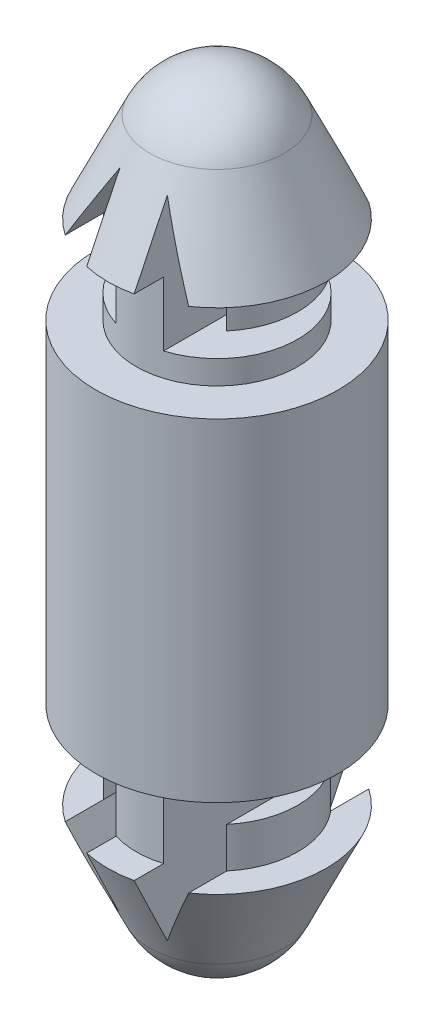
ISO-10303-21;
HEADER;
FILE_DESCRIPTION(('STEP AP214'),'2;1');
FILE_NAME('part.step','',(''),(''),'','','');
FILE_SCHEMA(('AUTOMOTIVE_DESIGN { 1 0 10303 214 1 1 1 1 }'));
ENDSEC;
DATA;
#1=APPLICATION_CONTEXT('core data for automotive mechanical design processes');
#2=APPLICATION_PROTOCOL_DEFINITION('international standard','automotive_design',2000,#1);
#3=PRODUCT_CONTEXT('',#1,'mechanical');
#4=PRODUCT('Part','Part','',(#3));
#5=PRODUCT_RELATED_PRODUCT_CATEGORY('part','',(#4));
#6=PRODUCT_DEFINITION_FORMATION('','',#4);
#7=PRODUCT_DEFINITION_CONTEXT('part definition',#1,'design');
#8=PRODUCT_DEFINITION('design','',#6,#7);
#9=PRODUCT_DEFINITION_SHAPE('','',#8);
#10=(LENGTH_UNIT() NAMED_UNIT(*) SI_UNIT(.MILLI.,.METRE.));
#11=(NAMED_UNIT(*) PLANE_ANGLE_UNIT() SI_UNIT($,.RADIAN.));
#12=(NAMED_UNIT(*) SI_UNIT($,.STERADIAN.) SOLID_ANGLE_UNIT());
#13=UNCERTAINTY_MEASURE_WITH_UNIT(LENGTH_MEASURE(1.E-05),#10,'distance_accuracy_value','');
#14=(GEOMETRIC_REPRESENTATION_CONTEXT(3) GLOBAL_UNCERTAINTY_ASSIGNED_CONTEXT((#13)) GLOBAL_UNIT_ASSIGNED_CONTEXT((#10,
#11,#12)) REPRESENTATION_CONTEXT('',''));
#15=CARTESIAN_POINT('',(0.,0.,0.));
#16=DIRECTION('',(0.,0.,1.));
#17=DIRECTION('',(1.,0.,0.));
#18=AXIS2_PLACEMENT_3D('',#15,#16,#17);
#19=CARTESIAN_POINT('',(1.7,8.85,0.));
#20=DIRECTION('',(0.,-1.,0.));
#21=DIRECTION('',(0.,0.,-1.));
#22=AXIS2_PLACEMENT_3D('',#19,#20,#21);
#23=PLANE('',#22);
#24=DIRECTION('',(0.,0.,1.));
#25=VECTOR('',#24,1.);
#26=CARTESIAN_POINT('',(-1.3,8.85,-2.55));
#27=LINE('',#26,#25);
#28=CARTESIAN_POINT('',(-1.3,8.85,1.09544511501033));
#29=VERTEX_POINT('',#28);
#30=CARTESIAN_POINT('',(-1.3,8.85,1.89736659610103));
#31=VERTEX_POINT('',#30);
#32=EDGE_CURVE('E232',#29,#31,#27,.T.);
#33=ORIENTED_EDGE('',*,*,#32,.T.);
#34=CARTESIAN_POINT('',(0.,8.85,0.));
#35=DIRECTION('',(0.,-1.,0.));
#36=DIRECTION('',(0.,0.,-1.));
#37=AXIS2_PLACEMENT_3D('',#34,#35,#36);
#38=CIRCLE('',#37,2.3);
#39=CARTESIAN_POINT('',(-1.3,8.85,-1.89736659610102));
#40=VERTEX_POINT('',#39);
#41=EDGE_CURVE('E239',#31,#40,#38,.T.);
#42=ORIENTED_EDGE('',*,*,#41,.T.);
#43=CARTESIAN_POINT('',(-1.3,8.85,-1.09544511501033));
#44=VERTEX_POINT('',#43);
#45=EDGE_CURVE('E657',#40,#44,#27,.T.);
#46=ORIENTED_EDGE('',*,*,#45,.T.);
#47=CARTESIAN_POINT('',(0.,8.85,0.));
#48=DIRECTION('',(0.,-1.,0.));
#49=DIRECTION('',(0.,0.,-1.));
#50=AXIS2_PLACEMENT_3D('',#47,#48,#49);
#51=CIRCLE('',#50,1.7);
#52=EDGE_CURVE('E374',#29,#44,#51,.T.);
#53=ORIENTED_EDGE('',*,*,#52,.F.);
#54=EDGE_LOOP('',(#33,#42,#46,#53));
#55=FACE_BOUND('',#54,.T.);
#56=ADVANCED_FACE('F33',(#55),#23,.T.);
#57=DIRECTION('',(0.,0.,1.));
#58=VECTOR('',#57,1.);
#59=CARTESIAN_POINT('',(-0.5,8.85,0.));
#60=LINE('',#59,#58);
#61=CARTESIAN_POINT('',(-0.5,8.85,-2.24499443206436));
#62=VERTEX_POINT('',#61);
#63=CARTESIAN_POINT('',(-0.5,8.85,-1.62480768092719));
#64=VERTEX_POINT('',#63);
#65=EDGE_CURVE('E461',#62,#64,#60,.T.);
#66=ORIENTED_EDGE('',*,*,#65,.F.);
#67=CARTESIAN_POINT('',(0.5,8.85,-2.24499443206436));
#68=VERTEX_POINT('',#67);
#69=EDGE_CURVE('E378',#62,#68,#38,.T.);
#70=ORIENTED_EDGE('',*,*,#69,.T.);
#71=DIRECTION('',(0.,0.,-1.));
#72=VECTOR('',#71,1.);
#73=CARTESIAN_POINT('',(0.5,8.85,0.));
#74=LINE('',#73,#72);
#75=CARTESIAN_POINT('',(0.500000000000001,8.85,-1.62480768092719));
#76=VERTEX_POINT('',#75);
#77=EDGE_CURVE('E288',#76,#68,#74,.T.);
#78=ORIENTED_EDGE('',*,*,#77,.F.);
#79=EDGE_CURVE('E369',#64,#76,#51,.T.);
#80=ORIENTED_EDGE('',*,*,#79,.F.);
#81=EDGE_LOOP('',(#66,#70,#78,#80));
#82=FACE_BOUND('',#81,.T.);
#83=ADVANCED_FACE('F425',(#82),#23,.T.);
#84=CARTESIAN_POINT('',(0.,-4.65,0.));
#85=DIRECTION('',(0.,-1.,0.));
#86=DIRECTION('',(0.,0.,-1.));
#87=AXIS2_PLACEMENT_3D('',#84,#85,#86);
#88=CYLINDRICAL_SURFACE('',#87,1.7);
#89=DIRECTION('',(0.,-1.,0.));
#90=VECTOR('',#89,1.);
#91=CARTESIAN_POINT('',(-1.3,-4.65,-1.09544511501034));
#92=LINE('',#91,#90);
#93=CARTESIAN_POINT('',(-1.3,8.,-1.09544511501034));
#94=VERTEX_POINT('',#93);
#95=EDGE_CURVE('E642',#94,#44,#92,.F.);
#96=ORIENTED_EDGE('',*,*,#95,.F.);
#97=CARTESIAN_POINT('',(0.,8.,0.));
#98=DIRECTION('',(0.,1.,0.));
#99=DIRECTION('',(0.,0.,1.));
#100=AXIS2_PLACEMENT_3D('',#97,#98,#99);
#101=CIRCLE('',#100,1.7);
#102=CARTESIAN_POINT('',(-1.3,8.,1.09544511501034));
#103=VERTEX_POINT('',#102);
#104=EDGE_CURVE('E11',#103,#94,#101,.F.);
#105=ORIENTED_EDGE('',*,*,#104,.F.);
#106=DIRECTION('',(0.,-1.,0.));
#107=VECTOR('',#106,1.);
#108=CARTESIAN_POINT('',(-1.3,-4.65,1.09544511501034));
#109=LINE('',#108,#107);
#110=EDGE_CURVE('E648',#29,#103,#109,.T.);
#111=ORIENTED_EDGE('',*,*,#110,.F.);
#112=ORIENTED_EDGE('',*,*,#52,.T.);
#113=EDGE_LOOP('',(#96,#105,#111,#112));
#114=FACE_BOUND('',#113,.T.);
#115=ADVANCED_FACE('F431',(#114),#88,.T.);
#116=CARTESIAN_POINT('',(-0.5,8.85,1.62480768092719));
#117=VERTEX_POINT('',#116);
#118=CARTESIAN_POINT('',(-0.5,8.85000000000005,2.24499443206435));
#119=VERTEX_POINT('',#118);
#120=EDGE_CURVE('E218',#117,#119,#60,.T.);
#121=ORIENTED_EDGE('',*,*,#120,.F.);
#122=CARTESIAN_POINT('',(0.500000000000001,8.85,1.62480768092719));
#123=VERTEX_POINT('',#122);
#124=EDGE_CURVE('E370',#123,#117,#51,.T.);
#125=ORIENTED_EDGE('',*,*,#124,.F.);
#126=CARTESIAN_POINT('',(0.5,8.85,2.24499443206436));
#127=VERTEX_POINT('',#126);
#128=EDGE_CURVE('E289',#127,#123,#74,.T.);
#129=ORIENTED_EDGE('',*,*,#128,.F.);
#130=EDGE_CURVE('E375',#127,#119,#38,.T.);
#131=ORIENTED_EDGE('',*,*,#130,.T.);
#132=EDGE_LOOP('',(#121,#125,#129,#131));
#133=FACE_BOUND('',#132,.T.);
#134=ADVANCED_FACE('F433',(#133),#23,.T.);
#135=DIRECTION('',(0.,-1.,0.));
#136=VECTOR('',#135,1.);
#137=CARTESIAN_POINT('',(-0.500000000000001,-4.65,1.62480768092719));
#138=LINE('',#137,#136);
#139=CARTESIAN_POINT('',(-0.5,7.5,1.62480768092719));
#140=VERTEX_POINT('',#139);
#141=EDGE_CURVE('E458',#140,#117,#138,.F.);
#142=ORIENTED_EDGE('',*,*,#141,.F.);
#143=CARTESIAN_POINT('',(0.,7.5,0.));
#144=DIRECTION('',(0.,-1.,0.));
#145=DIRECTION('',(0.,0.,-1.));
#146=AXIS2_PLACEMENT_3D('',#143,#144,#145);
#147=CIRCLE('',#146,1.7);
#148=CARTESIAN_POINT('',(-0.5,7.5,-1.62480768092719));
#149=VERTEX_POINT('',#148);
#150=EDGE_CURVE('E41',#149,#140,#147,.F.);
#151=ORIENTED_EDGE('',*,*,#150,.F.);
#152=DIRECTION('',(0.,-1.,0.));
#153=VECTOR('',#152,1.);
#154=CARTESIAN_POINT('',(-0.500000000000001,-4.65,-1.62480768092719));
#155=LINE('',#154,#153);
#156=EDGE_CURVE('E459',#64,#149,#155,.T.);
#157=ORIENTED_EDGE('',*,*,#156,.F.);
#158=ORIENTED_EDGE('',*,*,#79,.T.);
#159=DIRECTION('',(0.,-1.,0.));
#160=VECTOR('',#159,1.);
#161=CARTESIAN_POINT('',(0.500000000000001,-4.65,-1.62480768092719));
#162=LINE('',#161,#160);
#163=CARTESIAN_POINT('',(0.5,7.5,-1.62480768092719));
#164=VERTEX_POINT('',#163);
#165=EDGE_CURVE('E241',#164,#76,#162,.F.);
#166=ORIENTED_EDGE('',*,*,#165,.F.);
#167=CARTESIAN_POINT('',(0.,7.5,0.));
#168=DIRECTION('',(0.,-1.,0.));
#169=DIRECTION('',(0.,0.,-1.));
#170=AXIS2_PLACEMENT_3D('',#167,#168,#169);
#171=CIRCLE('',#170,1.7);
#172=CARTESIAN_POINT('',(0.5,7.5,1.62480768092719));
#173=VERTEX_POINT('',#172);
#174=EDGE_CURVE('E244',#173,#164,#171,.F.);
#175=ORIENTED_EDGE('',*,*,#174,.F.);
#176=DIRECTION('',(0.,-1.,0.));
#177=VECTOR('',#176,1.);
#178=CARTESIAN_POINT('',(0.500000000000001,-4.65,1.62480768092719));
#179=LINE('',#178,#177);
#180=EDGE_CURVE('E467',#123,#173,#179,.T.);
#181=ORIENTED_EDGE('',*,*,#180,.F.);
#182=ORIENTED_EDGE('',*,*,#124,.T.);
#183=EDGE_LOOP('',(#142,#151,#157,#158,#166,#175,#181,#182));
#184=FACE_BOUND('',#183,.T.);
#185=CARTESIAN_POINT('',(0.,7.,0.));
#186=DIRECTION('',(0.,-1.,0.));
#187=DIRECTION('',(0.,0.,-1.));
#188=AXIS2_PLACEMENT_3D('',#185,#186,#187);
#189=CIRCLE('',#188,1.7);
#190=CARTESIAN_POINT('',(0.,7.,-1.7));
#191=VERTEX_POINT('',#190);
#192=EDGE_CURVE('E366',#191,#191,#189,.T.);
#193=ORIENTED_EDGE('',*,*,#192,.F.);
#194=EDGE_LOOP('',(#193));
#195=FACE_BOUND('',#194,.T.);
#196=ADVANCED_FACE('F444',(#184,#195),#88,.T.);
#197=CARTESIAN_POINT('',(0.,-4.65,0.));
#198=DIRECTION('',(0.,-1.,0.));
#199=DIRECTION('',(0.,0.,-1.));
#200=AXIS2_PLACEMENT_3D('',#197,#198,#199);
#201=CYLINDRICAL_SURFACE('',#200,1.7);
#202=DIRECTION('',(0.,-1.,0.));
#203=VECTOR('',#202,1.);
#204=CARTESIAN_POINT('',(1.3,-4.65,1.09544511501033));
#205=LINE('',#204,#203);
#206=CARTESIAN_POINT('',(1.3,-1.85,1.09544511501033));
#207=VERTEX_POINT('',#206);
#208=CARTESIAN_POINT('',(1.3,-1.,1.09544511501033));
#209=VERTEX_POINT('',#208);
#210=EDGE_CURVE('E315',#207,#209,#205,.F.);
#211=ORIENTED_EDGE('',*,*,#210,.F.);
#212=CARTESIAN_POINT('',(0.,-1.85,0.));
#213=DIRECTION('',(0.,-1.,0.));
#214=DIRECTION('',(0.,0.,-1.));
#215=AXIS2_PLACEMENT_3D('',#212,#213,#214);
#216=CIRCLE('',#215,1.7);
#217=CARTESIAN_POINT('',(1.3,-1.85,-1.09544511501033));
#218=VERTEX_POINT('',#217);
#219=EDGE_CURVE('E355',#218,#207,#216,.T.);
#220=ORIENTED_EDGE('',*,*,#219,.F.);
#221=DIRECTION('',(0.,-1.,0.));
#222=VECTOR('',#221,1.);
#223=CARTESIAN_POINT('',(1.3,-4.65,-1.09544511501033));
#224=LINE('',#223,#222);
#225=CARTESIAN_POINT('',(1.3,-1.,-1.09544511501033));
#226=VERTEX_POINT('',#225);
#227=EDGE_CURVE('E313',#226,#218,#224,.T.);
#228=ORIENTED_EDGE('',*,*,#227,.F.);
#229=CARTESIAN_POINT('',(0.,-1.,0.));
#230=DIRECTION('',(0.,-1.,0.));
#231=DIRECTION('',(0.,0.,-1.));
#232=AXIS2_PLACEMENT_3D('',#229,#230,#231);
#233=CIRCLE('',#232,1.7);
#234=EDGE_CURVE('E479',#209,#226,#233,.F.);
#235=ORIENTED_EDGE('',*,*,#234,.F.);
#236=EDGE_LOOP('',(#211,#220,#228,#235));
#237=FACE_BOUND('',#236,.T.);
#238=ADVANCED_FACE('F453',(#237),#201,.T.);
#239=CARTESIAN_POINT('',(1.7,-1.85,0.));
#240=DIRECTION('',(0.,1.,0.));
#241=DIRECTION('',(0.,0.,1.));
#242=AXIS2_PLACEMENT_3D('',#239,#240,#241);
#243=PLANE('',#242);
#244=DIRECTION('',(0.,0.,1.));
#245=VECTOR('',#244,1.);
#246=CARTESIAN_POINT('',(1.3,-1.85,-2.55));
#247=LINE('',#246,#245);
#248=CARTESIAN_POINT('',(1.3,-1.85,1.89736659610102));
#249=VERTEX_POINT('',#248);
#250=EDGE_CURVE('E297',#207,#249,#247,.T.);
#251=ORIENTED_EDGE('',*,*,#250,.T.);
#252=CARTESIAN_POINT('',(0.,-1.85,0.));
#253=DIRECTION('',(0.,-1.,0.));
#254=DIRECTION('',(0.,0.,-1.));
#255=AXIS2_PLACEMENT_3D('',#252,#253,#254);
#256=CIRCLE('',#255,2.3);
#257=CARTESIAN_POINT('',(1.3,-1.85,-1.89736659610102));
#258=VERTEX_POINT('',#257);
#259=EDGE_CURVE('E350',#258,#249,#256,.T.);
#260=ORIENTED_EDGE('',*,*,#259,.F.);
#261=EDGE_CURVE('E296',#258,#218,#247,.T.);
#262=ORIENTED_EDGE('',*,*,#261,.T.);
#263=ORIENTED_EDGE('',*,*,#219,.T.);
#264=EDGE_LOOP('',(#251,#260,#262,#263));
#265=FACE_BOUND('',#264,.T.);
#266=ADVANCED_FACE('F547',(#265),#243,.T.);
#267=DIRECTION('',(0.,0.,1.));
#268=VECTOR('',#267,1.);
#269=CARTESIAN_POINT('',(0.5,-1.85,0.));
#270=LINE('',#269,#268);
#271=CARTESIAN_POINT('',(0.5,-1.85,-2.24499443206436));
#272=VERTEX_POINT('',#271);
#273=CARTESIAN_POINT('',(0.5,-1.85,-1.62480768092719));
#274=VERTEX_POINT('',#273);
#275=EDGE_CURVE('E295',#272,#274,#270,.T.);
#276=ORIENTED_EDGE('',*,*,#275,.F.);
#277=CARTESIAN_POINT('',(-0.5,-1.85000000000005,-2.24499443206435));
#278=VERTEX_POINT('',#277);
#279=EDGE_CURVE('E346',#278,#272,#256,.T.);
#280=ORIENTED_EDGE('',*,*,#279,.F.);
#281=DIRECTION('',(0.,0.,-1.));
#282=VECTOR('',#281,1.);
#283=CARTESIAN_POINT('',(-0.5,-1.85,0.));
#284=LINE('',#283,#282);
#285=CARTESIAN_POINT('',(-0.5,-1.85,-1.62480768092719));
#286=VERTEX_POINT('',#285);
#287=EDGE_CURVE('E338',#286,#278,#284,.T.);
#288=ORIENTED_EDGE('',*,*,#287,.F.);
#289=EDGE_CURVE('E351',#286,#274,#216,.T.);
#290=ORIENTED_EDGE('',*,*,#289,.T.);
#291=EDGE_LOOP('',(#276,#280,#288,#290));
#292=FACE_BOUND('',#291,.T.);
#293=ADVANCED_FACE('F537',(#292),#243,.T.);
#294=DIRECTION('',(0.,-1.,0.));
#295=VECTOR('',#294,1.);
#296=CARTESIAN_POINT('',(0.5,-4.65,-1.62480768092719));
#297=LINE('',#296,#295);
#298=CARTESIAN_POINT('',(0.5,-0.5,-1.62480768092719));
#299=VERTEX_POINT('',#298);
#300=EDGE_CURVE('E308',#274,#299,#297,.F.);
#301=ORIENTED_EDGE('',*,*,#300,.F.);
#302=ORIENTED_EDGE('',*,*,#289,.F.);
#303=DIRECTION('',(0.,-1.,0.));
#304=VECTOR('',#303,1.);
#305=CARTESIAN_POINT('',(-0.5,-4.65,-1.62480768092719));
#306=LINE('',#305,#304);
#307=CARTESIAN_POINT('',(-0.5,-0.5,-1.62480768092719));
#308=VERTEX_POINT('',#307);
#309=EDGE_CURVE('E340',#308,#286,#306,.T.);
#310=ORIENTED_EDGE('',*,*,#309,.F.);
#311=CARTESIAN_POINT('',(0.,-0.5,0.));
#312=DIRECTION('',(0.,1.,0.));
#313=DIRECTION('',(0.,0.,1.));
#314=AXIS2_PLACEMENT_3D('',#311,#312,#313);
#315=CIRCLE('',#314,1.7);
#316=CARTESIAN_POINT('',(-0.5,-0.5,1.62480768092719));
#317=VERTEX_POINT('',#316);
#318=EDGE_CURVE('E493',#317,#308,#315,.F.);
#319=ORIENTED_EDGE('',*,*,#318,.F.);
#320=DIRECTION('',(0.,-1.,0.));
#321=VECTOR('',#320,1.);
#322=CARTESIAN_POINT('',(-0.5,-4.65,1.62480768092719));
#323=LINE('',#322,#321);
#324=CARTESIAN_POINT('',(-0.5,-1.85,1.62480768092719));
#325=VERTEX_POINT('',#324);
#326=EDGE_CURVE('E337',#325,#317,#323,.F.);
#327=ORIENTED_EDGE('',*,*,#326,.F.);
#328=CARTESIAN_POINT('',(0.5,-1.85,1.62480768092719));
#329=VERTEX_POINT('',#328);
#330=EDGE_CURVE('E356',#329,#325,#216,.T.);
#331=ORIENTED_EDGE('',*,*,#330,.F.);
#332=DIRECTION('',(0.,-1.,0.));
#333=VECTOR('',#332,1.);
#334=CARTESIAN_POINT('',(0.5,-4.65,1.62480768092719));
#335=LINE('',#334,#333);
#336=CARTESIAN_POINT('',(0.5,-0.5,1.62480768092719));
#337=VERTEX_POINT('',#336);
#338=EDGE_CURVE('E311',#337,#329,#335,.T.);
#339=ORIENTED_EDGE('',*,*,#338,.F.);
#340=CARTESIAN_POINT('',(0.,-0.5,0.));
#341=DIRECTION('',(0.,1.,0.));
#342=DIRECTION('',(0.,0.,1.));
#343=AXIS2_PLACEMENT_3D('',#340,#341,#342);
#344=CIRCLE('',#343,1.7);
#345=EDGE_CURVE('E481',#299,#337,#344,.F.);
#346=ORIENTED_EDGE('',*,*,#345,.F.);
#347=EDGE_LOOP('',(#301,#302,#310,#319,#327,#331,#339,#346));
#348=FACE_BOUND('',#347,.T.);
#349=CARTESIAN_POINT('',(0.,0.,0.));
#350=DIRECTION('',(0.,-1.,0.));
#351=DIRECTION('',(0.,0.,-1.));
#352=AXIS2_PLACEMENT_3D('',#349,#350,#351);
#353=CIRCLE('',#352,1.7);
#354=CARTESIAN_POINT('',(0.,0.,-1.7));
#355=VERTEX_POINT('',#354);
#356=EDGE_CURVE('E357',#355,#355,#353,.T.);
#357=ORIENTED_EDGE('',*,*,#356,.T.);
#358=EDGE_LOOP('',(#357));
#359=FACE_BOUND('',#358,.T.);
#360=ADVANCED_FACE('F513',(#348,#359),#201,.T.);
#361=CARTESIAN_POINT('',(0.5,-1.85000000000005,2.24499443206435));
#362=VERTEX_POINT('',#361);
#363=EDGE_CURVE('E309',#329,#362,#270,.T.);
#364=ORIENTED_EDGE('',*,*,#363,.F.);
#365=ORIENTED_EDGE('',*,*,#330,.T.);
#366=CARTESIAN_POINT('',(-0.5,-1.85,2.24499443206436));
#367=VERTEX_POINT('',#366);
#368=EDGE_CURVE('E334',#367,#325,#284,.T.);
#369=ORIENTED_EDGE('',*,*,#368,.F.);
#370=EDGE_CURVE('E345',#362,#367,#256,.T.);
#371=ORIENTED_EDGE('',*,*,#370,.F.);
#372=EDGE_LOOP('',(#364,#365,#369,#371));
#373=FACE_BOUND('',#372,.T.);
#374=ADVANCED_FACE('F534',(#373),#243,.T.);
#375=CARTESIAN_POINT('',(0.,-3.08920110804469,0.));
#376=DIRECTION('',(0.,-1.,0.));
#377=DIRECTION('',(-1.,0.,0.));
#378=AXIS2_PLACEMENT_3D('',#375,#376,#377);
#379=SPHERICAL_SURFACE('',#378,1.56079889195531);
#380=CARTESIAN_POINT('',(0.,-3.74882322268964,0.));
#381=DIRECTION('',(0.,-1.,0.));
#382=DIRECTION('',(0.,0.,-1.));
#383=AXIS2_PLACEMENT_3D('',#380,#381,#382);
#384=CIRCLE('',#383,1.41456418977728);
#385=CARTESIAN_POINT('',(0.,-3.74882322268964,-1.41456418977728));
#386=VERTEX_POINT('',#385);
#387=EDGE_CURVE('E342',#386,#386,#384,.T.);
#388=ORIENTED_EDGE('',*,*,#387,.T.);
#389=EDGE_LOOP('',(#388));
#390=FACE_BOUND('',#389,.T.);
#391=ADVANCED_FACE('F35',(#390),#379,.T.);
#392=CARTESIAN_POINT('',(0.,10.0892011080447,0.));
#393=DIRECTION('',(0.,-1.,0.));
#394=DIRECTION('',(1.,0.,0.));
#395=AXIS2_PLACEMENT_3D('',#392,#393,#394);
#396=SPHERICAL_SURFACE('',#395,1.56079889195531);
#397=CARTESIAN_POINT('',(0.,10.7488232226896,0.));
#398=DIRECTION('',(0.,-1.,0.));
#399=DIRECTION('',(0.,0.,-1.));
#400=AXIS2_PLACEMENT_3D('',#397,#398,#399);
#401=CIRCLE('',#400,1.41456418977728);
#402=CARTESIAN_POINT('',(0.,10.7488232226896,-1.41456418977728));
#403=VERTEX_POINT('',#402);
#404=EDGE_CURVE('E379',#403,#403,#401,.T.);
#405=ORIENTED_EDGE('',*,*,#404,.F.);
#406=EDGE_LOOP('',(#405));
#407=FACE_BOUND('',#406,.T.);
#408=ADVANCED_FACE('F445',(#407),#396,.T.);
#409=CARTESIAN_POINT('',(0.,8.85,0.));
#410=DIRECTION('',(0.,-1.,0.));
#411=DIRECTION('',(0.,0.,-1.));
#412=AXIS2_PLACEMENT_3D('',#409,#410,#411);
#413=CONICAL_SURFACE('',#412,2.3,0.436332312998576);
#414=CARTESIAN_POINT('',(-3.55409858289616,4.76444631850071,0.));
#415=DIRECTION('',(-0.875577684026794,0.483077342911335,0.));
#416=DIRECTION('',(-0.483077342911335,-0.875577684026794,0.));
#417=AXIS2_PLACEMENT_3D('',#414,#415,#416);
#418=ELLIPSE('',#417,8.70486896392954,2.24754516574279);
#419=CARTESIAN_POINT('',(-0.5,10.3,1.54496002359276));
#420=VERTEX_POINT('',#419);
#421=EDGE_CURVE('E223',#420,#31,#418,.F.);
#422=ORIENTED_EDGE('',*,*,#421,.F.);
#423=CARTESIAN_POINT('',(-0.5,5.9559271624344,3.61511507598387));
#424=CARTESIAN_POINT('',(-0.5,6.14903162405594,3.52420993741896));
#425=CARTESIAN_POINT('',(-0.5,6.34211276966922,3.4332551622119));
#426=CARTESIAN_POINT('',(-0.5,6.72821224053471,3.2512113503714));
#427=CARTESIAN_POINT('',(-0.5,6.92123056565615,3.16012231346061));
#428=CARTESIAN_POINT('',(-0.5,7.50023988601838,2.88656690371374));
#429=CARTESIAN_POINT('',(-0.5,7.88611110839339,2.70384709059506));
#430=CARTESIAN_POINT('',(-0.5,8.65850088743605,2.33668057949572));
#431=CARTESIAN_POINT('',(-0.5,9.04501773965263,2.15223028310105));
#432=CARTESIAN_POINT('',(-0.5,9.62386870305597,1.87370296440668));
#433=CARTESIAN_POINT('',(-0.5,9.81665124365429,1.78055859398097));
#434=CARTESIAN_POINT('',(-0.5,10.2017344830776,1.59328058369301));
#435=CARTESIAN_POINT('',(-0.5,10.3940351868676,1.49914695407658));
#436=CARTESIAN_POINT('',(-0.5,10.7161890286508,1.33967775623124));
#437=CARTESIAN_POINT('',(-0.5,10.8462685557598,1.27479992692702));
#438=CARTESIAN_POINT('',(-0.5,11.1058577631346,1.1438238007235));
#439=CARTESIAN_POINT('',(-0.5,11.2353672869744,1.07772519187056));
#440=CARTESIAN_POINT('',(-0.5,11.4288793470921,0.977041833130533));
#441=CARTESIAN_POINT('',(-0.5,11.4932758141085,0.943215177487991));
#442=CARTESIAN_POINT('',(-0.5,11.6217006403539,0.874871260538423));
#443=CARTESIAN_POINT('',(-0.499999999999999,11.6857290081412,0.840354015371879));
#444=CARTESIAN_POINT('',(-0.499999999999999,11.8132356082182,0.770369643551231));
#445=CARTESIAN_POINT('',(-0.499999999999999,11.8767140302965,0.734902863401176));
#446=CARTESIAN_POINT('',(-0.499999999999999,12.0028687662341,0.662574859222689));
#447=CARTESIAN_POINT('',(-0.499999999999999,12.0655451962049,0.625713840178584));
#448=CARTESIAN_POINT('',(-0.499999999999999,12.1581873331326,0.568990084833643));
#449=CARTESIAN_POINT('',(-0.499999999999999,12.1886621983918,0.549960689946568));
#450=CARTESIAN_POINT('',(-0.499999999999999,12.2491635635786,0.511197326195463));
#451=CARTESIAN_POINT('',(-0.499999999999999,12.279190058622,0.49146334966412));
#452=CARTESIAN_POINT('',(-0.499999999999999,12.338525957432,0.45112337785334));
#453=CARTESIAN_POINT('',(-0.499999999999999,12.3678372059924,0.430520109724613));
#454=CARTESIAN_POINT('',(-0.499999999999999,12.4255470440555,0.388040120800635));
#455=CARTESIAN_POINT('',(-0.499999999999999,12.4539454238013,0.366163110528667));
#456=CARTESIAN_POINT('',(-0.499999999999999,12.5016487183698,0.326867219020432));
#457=CARTESIAN_POINT('',(-0.499999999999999,12.5213053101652,0.309878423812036));
#458=CARTESIAN_POINT('',(-0.499999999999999,12.5594407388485,0.274640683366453));
#459=CARTESIAN_POINT('',(-0.499999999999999,12.5779207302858,0.2563930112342));
#460=CARTESIAN_POINT('',(-0.499999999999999,12.6132772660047,0.217948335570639));
#461=CARTESIAN_POINT('',(-0.499999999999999,12.6301305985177,0.197729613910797));
#462=CARTESIAN_POINT('',(-0.499999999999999,12.6606111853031,0.154979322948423));
#463=CARTESIAN_POINT('',(-0.499999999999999,12.6742530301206,0.13245890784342));
#464=CARTESIAN_POINT('',(-0.499999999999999,12.6910518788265,0.0955480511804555));
#465=CARTESIAN_POINT('',(-0.499999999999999,12.6961638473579,0.0820645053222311));
#466=CARTESIAN_POINT('',(-0.499999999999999,12.7041685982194,0.0544568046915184));
#467=CARTESIAN_POINT('',(-0.499999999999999,12.7070654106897,0.0403338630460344));
#468=CARTESIAN_POINT('',(-0.499999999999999,12.7102605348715,0.0116800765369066));
#469=CARTESIAN_POINT('',(-0.499999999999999,12.7105397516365,-0.00285299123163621));
#470=CARTESIAN_POINT('',(-0.499999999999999,12.7084036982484,-0.0317225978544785));
#471=CARTESIAN_POINT('',(-0.499999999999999,12.7059860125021,-0.0460589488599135));
#472=CARTESIAN_POINT('',(-0.499999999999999,12.6980503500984,-0.0770813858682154));
#473=CARTESIAN_POINT('',(-0.499999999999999,12.6919850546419,-0.0936235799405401));
#474=CARTESIAN_POINT('',(-0.499999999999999,12.6773378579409,-0.125546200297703));
#475=CARTESIAN_POINT('',(-0.499999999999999,12.6687499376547,-0.140923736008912));
#476=CARTESIAN_POINT('',(-0.499999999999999,12.6482289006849,-0.173102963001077));
#477=CARTESIAN_POINT('',(-0.499999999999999,12.635974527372,-0.189695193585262));
#478=CARTESIAN_POINT('',(-0.499999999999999,12.6099197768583,-0.221634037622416));
#479=CARTESIAN_POINT('',(-0.499999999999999,12.5961165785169,-0.236978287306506));
#480=CARTESIAN_POINT('',(-0.499999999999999,12.5673895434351,-0.266758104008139));
#481=CARTESIAN_POINT('',(-0.499999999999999,12.5524590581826,-0.281187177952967));
#482=CARTESIAN_POINT('',(-0.499999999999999,12.5218823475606,-0.309228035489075));
#483=CARTESIAN_POINT('',(-0.499999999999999,12.5062367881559,-0.322840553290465));
#484=CARTESIAN_POINT('',(-0.499999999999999,12.4559681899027,-0.364867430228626));
#485=CARTESIAN_POINT('',(-0.499999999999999,12.4203878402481,-0.392131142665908));
#486=CARTESIAN_POINT('',(-0.499999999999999,12.3478705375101,-0.444803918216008));
#487=CARTESIAN_POINT('',(-0.499999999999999,12.3109324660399,-0.470211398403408));
#488=CARTESIAN_POINT('',(-0.499999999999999,12.2361199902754,-0.519798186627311));
#489=CARTESIAN_POINT('',(-0.499999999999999,12.1982436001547,-0.543974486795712));
#490=CARTESIAN_POINT('',(-0.499999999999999,12.1219136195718,-0.591401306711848));
#491=CARTESIAN_POINT('',(-0.499999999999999,12.0834599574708,-0.614651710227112));
#492=CARTESIAN_POINT('',(-0.499999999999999,11.9674448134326,-0.683412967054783));
#493=CARTESIAN_POINT('',(-0.499999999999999,11.8892792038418,-0.727901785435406));
#494=CARTESIAN_POINT('',(-0.499999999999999,11.7321772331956,-0.815182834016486));
#495=CARTESIAN_POINT('',(-0.5,11.6532422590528,-0.857977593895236));
#496=CARTESIAN_POINT('',(-0.5,11.4956176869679,-0.942055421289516));
#497=CARTESIAN_POINT('',(-0.5,11.4169339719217,-0.983349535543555));
#498=CARTESIAN_POINT('',(-0.5,11.259185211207,-1.06520235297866));
#499=CARTESIAN_POINT('',(-0.5,11.1801201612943,-1.10576104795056));
#500=CARTESIAN_POINT('',(-0.5,10.9425123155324,-1.22665318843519));
#501=CARTESIAN_POINT('',(-0.5,10.7835681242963,-1.30619674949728));
#502=CARTESIAN_POINT('',(-0.5,10.464962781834,-1.46413717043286));
#503=CARTESIAN_POINT('',(-0.5,10.3053011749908,-1.54253310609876));
#504=CARTESIAN_POINT('',(-0.5,9.98560484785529,-1.69854436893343));
#505=CARTESIAN_POINT('',(-0.5,9.82557014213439,-1.77615972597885));
#506=CARTESIAN_POINT('',(-0.5,9.50564865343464,-1.9306731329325));
#507=CARTESIAN_POINT('',(-0.5,9.34576250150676,-2.00757249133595));
#508=CARTESIAN_POINT('',(-0.5,9.02581055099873,-2.16100042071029));
#509=CARTESIAN_POINT('',(-0.5,8.86574475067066,-2.2375289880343));
#510=CARTESIAN_POINT('',(-0.5,8.38543430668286,-2.46667434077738));
#511=CARTESIAN_POINT('',(-0.5,8.06499774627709,-2.6188887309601));
#512=CARTESIAN_POINT('',(-0.5,7.59556953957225,-2.84131822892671));
#513=CARTESIAN_POINT('',(-0.5,7.44669357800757,-2.91177794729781));
#514=CARTESIAN_POINT('',(-0.5,7.14888007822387,-3.05258964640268));
#515=CARTESIAN_POINT('',(-0.5,6.99994253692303,-3.12294162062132));
#516=CARTESIAN_POINT('',(-0.5,6.70184120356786,-3.26364217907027));
#517=CARTESIAN_POINT('',(-0.5,6.55267735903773,-3.33399065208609));
#518=CARTESIAN_POINT('',(-0.5,6.25432282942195,-3.4746079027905));
#519=CARTESIAN_POINT('',(-0.5,6.10513214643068,-3.54487668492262));
#520=CARTESIAN_POINT('',(-0.5,5.9559271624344,-3.61511507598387));
#521=B_SPLINE_CURVE_WITH_KNOTS('',3,(#423,#424,#425,#426,#427,#428,#429,#430,#431,#432,#433,
#434,#435,#436,#437,#438,#439,#440,#441,#442,#443,#444,#445,#446,#447,#448,#449,#450,#451,#452,
#453,#454,#455,#456,#457,#458,#459,#460,#461,#462,#463,#464,#465,#466,#467,#468,#469,#470,#471,
#472,#473,#474,#475,#476,#477,#478,#479,#480,#481,#482,#483,#484,#485,#486,#487,#488,#489,#490,
#491,#492,#493,#494,#495,#496,#497,#498,#499,#500,#501,#502,#503,#504,#505,#506,#507,#508,#509,
#510,#511,#512,#513,#514,#515,#516,#517,#518,#519,#520),.UNSPECIFIED.,.F.,.F.,(4,2,2,2,2,2,2,2,
2,2,2,2,2,2,2,2,2,2,2,2,2,2,2,2,2,2,2,2,2,2,2,2,2,2,2,2,2,2,2,2,2,2,2,2,2,2,2,2,4),(0.,
0.640295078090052,1.28059148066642,2.56143000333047,3.84624130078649,4.48855525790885,
5.13086256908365,5.56694268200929,6.00313581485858,6.2213538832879,6.43956685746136,
6.65770125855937,6.875803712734,6.98358151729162,7.09136049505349,7.19882338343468,
7.30631079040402,7.3842161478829,7.46204384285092,7.54085496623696,7.61930080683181,
7.66241373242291,7.70544803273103,7.74879601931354,7.79218286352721,7.84474092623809,
7.89742542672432,7.95916465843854,8.02101823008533,8.08327040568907,8.14546574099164,
8.27982166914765,8.41429086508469,8.54907420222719,8.68387440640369,8.95365299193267,
9.22301223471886,9.48959005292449,9.75617084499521,10.2893707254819,10.822978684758,
11.3565661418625,11.8888191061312,12.4210772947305,13.4853310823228,13.9794541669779,
14.4736060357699,14.9683674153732,15.4630996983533),.UNSPECIFIED.);
#522=EDGE_CURVE('E215',#119,#420,#521,.T.);
#523=ORIENTED_EDGE('',*,*,#522,.F.);
#524=ORIENTED_EDGE('',*,*,#130,.F.);
#525=CARTESIAN_POINT('',(0.5,5.9559271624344,-3.61511507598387));
#526=CARTESIAN_POINT('',(0.5,6.14903162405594,-3.52420993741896));
#527=CARTESIAN_POINT('',(0.5,6.34211276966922,-3.4332551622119));
#528=CARTESIAN_POINT('',(0.5,6.72821224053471,-3.2512113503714));
#529=CARTESIAN_POINT('',(0.5,6.92123056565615,-3.16012231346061));
#530=CARTESIAN_POINT('',(0.5,7.50023988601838,-2.88656690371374));
#531=CARTESIAN_POINT('',(0.5,7.88611110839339,-2.70384709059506));
#532=CARTESIAN_POINT('',(0.5,8.65850088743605,-2.33668057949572));
#533=CARTESIAN_POINT('',(0.5,9.04501773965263,-2.15223028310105));
#534=CARTESIAN_POINT('',(0.5,9.62386870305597,-1.87370296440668));
#535=CARTESIAN_POINT('',(0.5,9.81665124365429,-1.78055859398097));
#536=CARTESIAN_POINT('',(0.5,10.2017344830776,-1.59328058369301));
#537=CARTESIAN_POINT('',(0.5,10.3940351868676,-1.49914695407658));
#538=CARTESIAN_POINT('',(0.5,10.7161890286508,-1.33967775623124));
#539=CARTESIAN_POINT('',(0.5,10.8462685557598,-1.27479992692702));
#540=CARTESIAN_POINT('',(0.5,11.1058577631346,-1.1438238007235));
#541=CARTESIAN_POINT('',(0.5,11.2353672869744,-1.07772519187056));
#542=CARTESIAN_POINT('',(0.5,11.4288793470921,-0.977041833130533));
#543=CARTESIAN_POINT('',(0.5,11.4932758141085,-0.943215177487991));
#544=CARTESIAN_POINT('',(0.5,11.6217006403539,-0.874871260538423));
#545=CARTESIAN_POINT('',(0.499999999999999,11.6857290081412,-0.840354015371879));
#546=CARTESIAN_POINT('',(0.499999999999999,11.8132356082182,-0.770369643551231));
#547=CARTESIAN_POINT('',(0.499999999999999,11.8767140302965,-0.734902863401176));
#548=CARTESIAN_POINT('',(0.499999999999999,12.0028687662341,-0.662574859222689));
#549=CARTESIAN_POINT('',(0.499999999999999,12.0655451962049,-0.625713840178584));
#550=CARTESIAN_POINT('',(0.499999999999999,12.1581873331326,-0.568990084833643));
#551=CARTESIAN_POINT('',(0.499999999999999,12.1886621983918,-0.549960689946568));
#552=CARTESIAN_POINT('',(0.499999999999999,12.2491635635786,-0.511197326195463));
#553=CARTESIAN_POINT('',(0.499999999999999,12.279190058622,-0.49146334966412));
#554=CARTESIAN_POINT('',(0.499999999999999,12.338525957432,-0.45112337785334));
#555=CARTESIAN_POINT('',(0.499999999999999,12.3678372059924,-0.430520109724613));
#556=CARTESIAN_POINT('',(0.499999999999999,12.4255470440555,-0.388040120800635));
#557=CARTESIAN_POINT('',(0.499999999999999,12.4539454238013,-0.366163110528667));
#558=CARTESIAN_POINT('',(0.499999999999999,12.5016487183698,-0.326867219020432));
#559=CARTESIAN_POINT('',(0.499999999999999,12.5213053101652,-0.309878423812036));
#560=CARTESIAN_POINT('',(0.499999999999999,12.5594407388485,-0.274640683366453));
#561=CARTESIAN_POINT('',(0.499999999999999,12.5779207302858,-0.2563930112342));
#562=CARTESIAN_POINT('',(0.499999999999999,12.6132772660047,-0.217948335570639));
#563=CARTESIAN_POINT('',(0.499999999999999,12.6301305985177,-0.197729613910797));
#564=CARTESIAN_POINT('',(0.499999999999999,12.6606111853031,-0.154979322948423));
#565=CARTESIAN_POINT('',(0.499999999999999,12.6742530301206,-0.13245890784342));
#566=CARTESIAN_POINT('',(0.499999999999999,12.6910518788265,-0.0955480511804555));
#567=CARTESIAN_POINT('',(0.499999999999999,12.6961638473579,-0.0820645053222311));
#568=CARTESIAN_POINT('',(0.499999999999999,12.7041685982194,-0.0544568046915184));
#569=CARTESIAN_POINT('',(0.499999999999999,12.7070654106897,-0.0403338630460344));
#570=CARTESIAN_POINT('',(0.499999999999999,12.7102605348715,-0.0116800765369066));
#571=CARTESIAN_POINT('',(0.499999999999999,12.7105397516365,0.00285299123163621));
#572=CARTESIAN_POINT('',(0.499999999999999,12.7084036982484,0.0317225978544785));
#573=CARTESIAN_POINT('',(0.499999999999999,12.7059860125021,0.0460589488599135));
#574=CARTESIAN_POINT('',(0.499999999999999,12.6980503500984,0.0770813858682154));
#575=CARTESIAN_POINT('',(0.499999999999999,12.6919850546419,0.0936235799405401));
#576=CARTESIAN_POINT('',(0.499999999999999,12.6773378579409,0.125546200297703));
#577=CARTESIAN_POINT('',(0.499999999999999,12.6687499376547,0.140923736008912));
#578=CARTESIAN_POINT('',(0.499999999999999,12.6482289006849,0.173102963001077));
#579=CARTESIAN_POINT('',(0.499999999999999,12.635974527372,0.189695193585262));
#580=CARTESIAN_POINT('',(0.499999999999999,12.6099197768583,0.221634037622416));
#581=CARTESIAN_POINT('',(0.499999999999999,12.5961165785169,0.236978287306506));
#582=CARTESIAN_POINT('',(0.499999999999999,12.5673895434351,0.266758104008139));
#583=CARTESIAN_POINT('',(0.499999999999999,12.5524590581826,0.281187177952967));
#584=CARTESIAN_POINT('',(0.499999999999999,12.5218823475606,0.309228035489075));
#585=CARTESIAN_POINT('',(0.499999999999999,12.5062367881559,0.322840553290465));
#586=CARTESIAN_POINT('',(0.499999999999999,12.4559681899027,0.364867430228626));
#587=CARTESIAN_POINT('',(0.499999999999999,12.4203878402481,0.392131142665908));
#588=CARTESIAN_POINT('',(0.499999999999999,12.3478705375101,0.444803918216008));
#589=CARTESIAN_POINT('',(0.499999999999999,12.3109324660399,0.470211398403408));
#590=CARTESIAN_POINT('',(0.499999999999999,12.2361199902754,0.519798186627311));
#591=CARTESIAN_POINT('',(0.499999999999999,12.1982436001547,0.543974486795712));
#592=CARTESIAN_POINT('',(0.499999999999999,12.1219136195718,0.591401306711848));
#593=CARTESIAN_POINT('',(0.499999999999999,12.0834599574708,0.614651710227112));
#594=CARTESIAN_POINT('',(0.499999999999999,11.9674448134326,0.683412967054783));
#595=CARTESIAN_POINT('',(0.499999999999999,11.8892792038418,0.727901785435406));
#596=CARTESIAN_POINT('',(0.499999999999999,11.7321772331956,0.815182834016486));
#597=CARTESIAN_POINT('',(0.5,11.6532422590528,0.857977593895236));
#598=CARTESIAN_POINT('',(0.5,11.4956176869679,0.942055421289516));
#599=CARTESIAN_POINT('',(0.5,11.4169339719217,0.983349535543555));
#600=CARTESIAN_POINT('',(0.5,11.259185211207,1.06520235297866));
#601=CARTESIAN_POINT('',(0.5,11.1801201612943,1.10576104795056));
#602=CARTESIAN_POINT('',(0.5,10.9425123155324,1.22665318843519));
#603=CARTESIAN_POINT('',(0.5,10.7835681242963,1.30619674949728));
#604=CARTESIAN_POINT('',(0.5,10.464962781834,1.46413717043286));
#605=CARTESIAN_POINT('',(0.5,10.3053011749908,1.54253310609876));
#606=CARTESIAN_POINT('',(0.5,9.98560484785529,1.69854436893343));
#607=CARTESIAN_POINT('',(0.5,9.82557014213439,1.77615972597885));
#608=CARTESIAN_POINT('',(0.5,9.50564865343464,1.9306731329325));
#609=CARTESIAN_POINT('',(0.5,9.34576250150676,2.00757249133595));
#610=CARTESIAN_POINT('',(0.5,9.02581055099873,2.16100042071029));
#611=CARTESIAN_POINT('',(0.5,8.86574475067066,2.2375289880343));
#612=CARTESIAN_POINT('',(0.5,8.38543430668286,2.46667434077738));
#613=CARTESIAN_POINT('',(0.5,8.06499774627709,2.6188887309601));
#614=CARTESIAN_POINT('',(0.5,7.59556953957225,2.84131822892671));
#615=CARTESIAN_POINT('',(0.5,7.44669357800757,2.91177794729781));
#616=CARTESIAN_POINT('',(0.5,7.14888007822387,3.05258964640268));
#617=CARTESIAN_POINT('',(0.5,6.99994253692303,3.12294162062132));
#618=CARTESIAN_POINT('',(0.5,6.70184120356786,3.26364217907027));
#619=CARTESIAN_POINT('',(0.5,6.55267735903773,3.33399065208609));
#620=CARTESIAN_POINT('',(0.5,6.25432282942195,3.4746079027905));
#621=CARTESIAN_POINT('',(0.5,6.10513214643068,3.54487668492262));
#622=CARTESIAN_POINT('',(0.5,5.9559271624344,3.61511507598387));
#623=B_SPLINE_CURVE_WITH_KNOTS('',3,(#525,#526,#527,#528,#529,#530,#531,#532,#533,#534,#535,
#536,#537,#538,#539,#540,#541,#542,#543,#544,#545,#546,#547,#548,#549,#550,#551,#552,#553,#554,
#555,#556,#557,#558,#559,#560,#561,#562,#563,#564,#565,#566,#567,#568,#569,#570,#571,#572,#573,
#574,#575,#576,#577,#578,#579,#580,#581,#582,#583,#584,#585,#586,#587,#588,#589,#590,#591,#592,
#593,#594,#595,#596,#597,#598,#599,#600,#601,#602,#603,#604,#605,#606,#607,#608,#609,#610,#611,
#612,#613,#614,#615,#616,#617,#618,#619,#620,#621,#622),.UNSPECIFIED.,.F.,.F.,(4,2,2,2,2,2,2,2,
2,2,2,2,2,2,2,2,2,2,2,2,2,2,2,2,2,2,2,2,2,2,2,2,2,2,2,2,2,2,2,2,2,2,2,2,2,2,2,2,4),(0.,
0.640295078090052,1.28059148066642,2.56143000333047,3.84624130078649,4.48855525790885,
5.13086256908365,5.56694268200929,6.00313581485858,6.2213538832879,6.43956685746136,
6.65770125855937,6.875803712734,6.98358151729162,7.09136049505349,7.19882338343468,
7.30631079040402,7.3842161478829,7.46204384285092,7.54085496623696,7.61930080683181,
7.66241373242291,7.70544803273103,7.74879601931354,7.79218286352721,7.84474092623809,
7.89742542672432,7.95916465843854,8.02101823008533,8.08327040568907,8.14546574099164,
8.27982166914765,8.41429086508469,8.54907420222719,8.68387440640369,8.95365299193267,
9.22301223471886,9.48959005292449,9.75617084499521,10.2893707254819,10.822978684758,
11.3565661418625,11.8888191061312,12.4210772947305,13.4853310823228,13.9794541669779,
14.4736060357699,14.9683674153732,15.4630996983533),.UNSPECIFIED.);
#624=CARTESIAN_POINT('',(0.5,10.3,1.54496002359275));
#625=VERTEX_POINT('',#624);
#626=EDGE_CURVE('E282',#625,#127,#623,.T.);
#627=ORIENTED_EDGE('',*,*,#626,.F.);
#628=CARTESIAN_POINT('',(3.55409858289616,4.76444631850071,0.));
#629=DIRECTION('',(0.875577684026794,0.483077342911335,0.));
#630=DIRECTION('',(0.483077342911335,-0.875577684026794,0.));
#631=AXIS2_PLACEMENT_3D('',#628,#629,#630);
#632=ELLIPSE('',#631,8.70486896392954,2.24754516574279);
#633=CARTESIAN_POINT('',(1.3,8.85,1.89736659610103));
#634=VERTEX_POINT('',#633);
#635=EDGE_CURVE('E637',#634,#625,#632,.F.);
#636=ORIENTED_EDGE('',*,*,#635,.F.);
#637=CARTESIAN_POINT('',(1.3,8.85,-1.89736659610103));
#638=VERTEX_POINT('',#637);
#639=EDGE_CURVE('E377',#638,#634,#38,.T.);
#640=ORIENTED_EDGE('',*,*,#639,.F.);
#641=CARTESIAN_POINT('',(0.5,10.3,-1.54496002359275));
#642=VERTEX_POINT('',#641);
#643=EDGE_CURVE('E638',#642,#638,#632,.F.);
#644=ORIENTED_EDGE('',*,*,#643,.F.);
#645=EDGE_CURVE('E290',#68,#642,#623,.T.);
#646=ORIENTED_EDGE('',*,*,#645,.F.);
#647=ORIENTED_EDGE('',*,*,#69,.F.);
#648=CARTESIAN_POINT('',(-0.5,10.3,-1.54496002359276));
#649=VERTEX_POINT('',#648);
#650=EDGE_CURVE('E226',#649,#62,#521,.T.);
#651=ORIENTED_EDGE('',*,*,#650,.F.);
#652=EDGE_CURVE('E224',#40,#649,#418,.F.);
#653=ORIENTED_EDGE('',*,*,#652,.F.);
#654=ORIENTED_EDGE('',*,*,#41,.F.);
#655=EDGE_LOOP('',(#422,#523,#524,#627,#636,#640,#644,#646,#647,#651,#653,#654));
#656=FACE_BOUND('',#655,.T.);
#657=ORIENTED_EDGE('',*,*,#404,.T.);
#658=EDGE_LOOP('',(#657));
#659=FACE_BOUND('',#658,.T.);
#660=ADVANCED_FACE('F236',(#656,#659),#413,.T.);
#661=DIRECTION('',(0.,0.,1.));
#662=VECTOR('',#661,1.);
#663=CARTESIAN_POINT('',(1.3,8.85,-2.55));
#664=LINE('',#663,#662);
#665=CARTESIAN_POINT('',(1.3,8.85,-1.09544511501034));
#666=VERTEX_POINT('',#665);
#667=EDGE_CURVE('E620',#638,#666,#664,.T.);
#668=ORIENTED_EDGE('',*,*,#667,.F.);
#669=ORIENTED_EDGE('',*,*,#639,.T.);
#670=CARTESIAN_POINT('',(1.3,8.85,1.09544511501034));
#671=VERTEX_POINT('',#670);
#672=EDGE_CURVE('E618',#671,#634,#664,.T.);
#673=ORIENTED_EDGE('',*,*,#672,.F.);
#674=EDGE_CURVE('E373',#666,#671,#51,.T.);
#675=ORIENTED_EDGE('',*,*,#674,.F.);
#676=EDGE_LOOP('',(#668,#669,#673,#675));
#677=FACE_BOUND('',#676,.T.);
#678=ADVANCED_FACE('F427',(#677),#23,.T.);
#679=DIRECTION('',(0.,-1.,0.));
#680=VECTOR('',#679,1.);
#681=CARTESIAN_POINT('',(1.3,-4.65,1.09544511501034));
#682=LINE('',#681,#680);
#683=CARTESIAN_POINT('',(1.3,8.,1.09544511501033));
#684=VERTEX_POINT('',#683);
#685=EDGE_CURVE('E471',#684,#671,#682,.F.);
#686=ORIENTED_EDGE('',*,*,#685,.F.);
#687=CARTESIAN_POINT('',(0.,8.,0.));
#688=DIRECTION('',(0.,1.,0.));
#689=DIRECTION('',(0.,0.,1.));
#690=AXIS2_PLACEMENT_3D('',#687,#688,#689);
#691=CIRCLE('',#690,1.7);
#692=CARTESIAN_POINT('',(1.3,8.,-1.09544511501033));
#693=VERTEX_POINT('',#692);
#694=EDGE_CURVE('E477',#693,#684,#691,.F.);
#695=ORIENTED_EDGE('',*,*,#694,.F.);
#696=DIRECTION('',(0.,-1.,0.));
#697=VECTOR('',#696,1.);
#698=CARTESIAN_POINT('',(1.3,-4.65,-1.09544511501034));
#699=LINE('',#698,#697);
#700=EDGE_CURVE('E473',#666,#693,#699,.T.);
#701=ORIENTED_EDGE('',*,*,#700,.F.);
#702=ORIENTED_EDGE('',*,*,#674,.T.);
#703=EDGE_LOOP('',(#686,#695,#701,#702));
#704=FACE_BOUND('',#703,.T.);
#705=ADVANCED_FACE('F436',(#704),#88,.T.);
#706=CARTESIAN_POINT('',(2.55,7.,0.));
#707=DIRECTION('',(0.,1.,0.));
#708=DIRECTION('',(0.,0.,1.));
#709=AXIS2_PLACEMENT_3D('',#706,#707,#708);
#710=PLANE('',#709);
#711=ORIENTED_EDGE('',*,*,#192,.T.);
#712=EDGE_LOOP('',(#711));
#713=FACE_BOUND('',#712,.T.);
#714=CARTESIAN_POINT('',(0.,7.,0.));
#715=DIRECTION('',(0.,-1.,0.));
#716=DIRECTION('',(0.,0.,-1.));
#717=AXIS2_PLACEMENT_3D('',#714,#715,#716);
#718=CIRCLE('',#717,2.55);
#719=CARTESIAN_POINT('',(0.,7.,-2.55));
#720=VERTEX_POINT('',#719);
#721=EDGE_CURVE('E363',#720,#720,#718,.T.);
#722=ORIENTED_EDGE('',*,*,#721,.F.);
#723=EDGE_LOOP('',(#722));
#724=FACE_BOUND('',#723,.T.);
#725=ADVANCED_FACE('F442',(#713,#724),#710,.T.);
#726=CARTESIAN_POINT('',(0.,-4.65,0.));
#727=DIRECTION('',(0.,-1.,0.));
#728=DIRECTION('',(0.,0.,-1.));
#729=AXIS2_PLACEMENT_3D('',#726,#727,#728);
#730=CYLINDRICAL_SURFACE('',#729,2.55);
#731=ORIENTED_EDGE('',*,*,#721,.T.);
#732=EDGE_LOOP('',(#731));
#733=FACE_BOUND('',#732,.T.);
#734=CARTESIAN_POINT('',(0.,0.,0.));
#735=DIRECTION('',(0.,-1.,0.));
#736=DIRECTION('',(0.,0.,-1.));
#737=AXIS2_PLACEMENT_3D('',#734,#735,#736);
#738=CIRCLE('',#737,2.55);
#739=CARTESIAN_POINT('',(0.,0.,-2.55));
#740=VERTEX_POINT('',#739);
#741=EDGE_CURVE('E360',#740,#740,#738,.T.);
#742=ORIENTED_EDGE('',*,*,#741,.F.);
#743=EDGE_LOOP('',(#742));
#744=FACE_BOUND('',#743,.T.);
#745=ADVANCED_FACE('F579',(#733,#744),#730,.T.);
#746=CARTESIAN_POINT('',(1.7,0.,0.));
#747=DIRECTION('',(0.,-1.,0.));
#748=DIRECTION('',(0.,0.,-1.));
#749=AXIS2_PLACEMENT_3D('',#746,#747,#748);
#750=PLANE('',#749);
#751=ORIENTED_EDGE('',*,*,#741,.T.);
#752=EDGE_LOOP('',(#751));
#753=FACE_BOUND('',#752,.T.);
#754=ORIENTED_EDGE('',*,*,#356,.F.);
#755=EDGE_LOOP('',(#754));
#756=FACE_BOUND('',#755,.T.);
#757=ADVANCED_FACE('F575',(#753,#756),#750,.T.);
#758=DIRECTION('',(0.,-1.,0.));
#759=VECTOR('',#758,1.);
#760=CARTESIAN_POINT('',(-1.3,-4.65,-1.09544511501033));
#761=LINE('',#760,#759);
#762=CARTESIAN_POINT('',(-1.3,-1.85,-1.09544511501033));
#763=VERTEX_POINT('',#762);
#764=CARTESIAN_POINT('',(-1.3,-1.,-1.09544511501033));
#765=VERTEX_POINT('',#764);
#766=EDGE_CURVE('E332',#763,#765,#761,.F.);
#767=ORIENTED_EDGE('',*,*,#766,.F.);
#768=CARTESIAN_POINT('',(-1.3,-1.85,1.09544511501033));
#769=VERTEX_POINT('',#768);
#770=EDGE_CURVE('E354',#769,#763,#216,.T.);
#771=ORIENTED_EDGE('',*,*,#770,.F.);
#772=DIRECTION('',(0.,-1.,0.));
#773=VECTOR('',#772,1.);
#774=CARTESIAN_POINT('',(-1.3,-4.65,1.09544511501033));
#775=LINE('',#774,#773);
#776=CARTESIAN_POINT('',(-1.3,-1.,1.09544511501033));
#777=VERTEX_POINT('',#776);
#778=EDGE_CURVE('E321',#777,#769,#775,.T.);
#779=ORIENTED_EDGE('',*,*,#778,.F.);
#780=CARTESIAN_POINT('',(0.,-1.,0.));
#781=DIRECTION('',(0.,-1.,0.));
#782=DIRECTION('',(0.,0.,-1.));
#783=AXIS2_PLACEMENT_3D('',#780,#781,#782);
#784=CIRCLE('',#783,1.7);
#785=EDGE_CURVE('E394',#765,#777,#784,.F.);
#786=ORIENTED_EDGE('',*,*,#785,.F.);
#787=EDGE_LOOP('',(#767,#771,#779,#786));
#788=FACE_BOUND('',#787,.T.);
#789=ADVANCED_FACE('F544',(#788),#201,.T.);
#790=DIRECTION('',(0.,0.,1.));
#791=VECTOR('',#790,1.);
#792=CARTESIAN_POINT('',(-1.3,-1.85,-2.55));
#793=LINE('',#792,#791);
#794=CARTESIAN_POINT('',(-1.3,-1.85,-1.89736659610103));
#795=VERTEX_POINT('',#794);
#796=EDGE_CURVE('E325',#795,#763,#793,.T.);
#797=ORIENTED_EDGE('',*,*,#796,.F.);
#798=CARTESIAN_POINT('',(-1.3,-1.85,1.89736659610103));
#799=VERTEX_POINT('',#798);
#800=EDGE_CURVE('E349',#799,#795,#256,.T.);
#801=ORIENTED_EDGE('',*,*,#800,.F.);
#802=EDGE_CURVE('E326',#769,#799,#793,.T.);
#803=ORIENTED_EDGE('',*,*,#802,.F.);
#804=ORIENTED_EDGE('',*,*,#770,.T.);
#805=EDGE_LOOP('',(#797,#801,#803,#804));
#806=FACE_BOUND('',#805,.T.);
#807=ADVANCED_FACE('F536',(#806),#243,.T.);
#808=CARTESIAN_POINT('',(0.,-3.74882322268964,0.));
#809=DIRECTION('',(0.,1.,0.));
#810=DIRECTION('',(0.,0.,1.));
#811=AXIS2_PLACEMENT_3D('',#808,#809,#810);
#812=CONICAL_SURFACE('',#811,1.41456418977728,0.436332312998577);
#813=CARTESIAN_POINT('',(3.55409858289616,2.2355536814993,0.));
#814=DIRECTION('',(0.875577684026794,-0.483077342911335,0.));
#815=DIRECTION('',(0.483077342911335,0.875577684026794,0.));
#816=AXIS2_PLACEMENT_3D('',#813,#814,#815);
#817=ELLIPSE('',#816,8.70486896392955,2.24754516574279);
#818=CARTESIAN_POINT('',(0.5,-3.3,1.54496002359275));
#819=VERTEX_POINT('',#818);
#820=EDGE_CURVE('E483',#819,#249,#817,.F.);
#821=ORIENTED_EDGE('',*,*,#820,.F.);
#822=CARTESIAN_POINT('',(0.5,1.0440728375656,3.61511507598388));
#823=CARTESIAN_POINT('',(0.5,0.850968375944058,3.52420993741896));
#824=CARTESIAN_POINT('',(0.5,0.65788723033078,3.43325516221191));
#825=CARTESIAN_POINT('',(0.5,0.27178775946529,3.2512113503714));
#826=CARTESIAN_POINT('',(0.5,0.0787694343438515,3.16012231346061));
#827=CARTESIAN_POINT('',(0.5,-0.500239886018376,2.88656690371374));
#828=CARTESIAN_POINT('',(0.5,-0.886111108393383,2.70384709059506));
#829=CARTESIAN_POINT('',(0.5,-1.65850088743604,2.33668057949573));
#830=CARTESIAN_POINT('',(0.5,-2.04501773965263,2.15223028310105));
#831=CARTESIAN_POINT('',(0.5,-2.62386870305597,1.87370296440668));
#832=CARTESIAN_POINT('',(0.5,-2.81665124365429,1.78055859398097));
#833=CARTESIAN_POINT('',(0.5,-3.20173448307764,1.59328058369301));
#834=CARTESIAN_POINT('',(0.5,-3.3940351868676,1.49914695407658));
#835=CARTESIAN_POINT('',(0.5,-3.71618902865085,1.33967775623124));
#836=CARTESIAN_POINT('',(0.5,-3.84626855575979,1.27479992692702));
#837=CARTESIAN_POINT('',(0.5,-4.10585776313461,1.1438238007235));
#838=CARTESIAN_POINT('',(0.5,-4.23536728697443,1.07772519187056));
#839=CARTESIAN_POINT('',(0.5,-4.4288793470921,0.977041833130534));
#840=CARTESIAN_POINT('',(0.5,-4.49327581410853,0.943215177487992));
#841=CARTESIAN_POINT('',(0.5,-4.62170064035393,0.874871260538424));
#842=CARTESIAN_POINT('',(0.5,-4.6857290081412,0.840354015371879));
#843=CARTESIAN_POINT('',(0.5,-4.81323560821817,0.770369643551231));
#844=CARTESIAN_POINT('',(0.5,-4.87671403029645,0.734902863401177));
#845=CARTESIAN_POINT('',(0.5,-5.00286876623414,0.66257485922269));
#846=CARTESIAN_POINT('',(0.5,-5.06554519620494,0.625713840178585));
#847=CARTESIAN_POINT('',(0.5,-5.15818733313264,0.568990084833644));
#848=CARTESIAN_POINT('',(0.5,-5.18866219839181,0.549960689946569));
#849=CARTESIAN_POINT('',(0.5,-5.24916356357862,0.511197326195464));
#850=CARTESIAN_POINT('',(0.5,-5.279190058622,0.49146334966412));
#851=CARTESIAN_POINT('',(0.5,-5.33852595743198,0.45112337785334));
#852=CARTESIAN_POINT('',(0.5,-5.3678372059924,0.430520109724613));
#853=CARTESIAN_POINT('',(0.5,-5.4255470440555,0.388040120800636));
#854=CARTESIAN_POINT('',(0.5,-5.45394542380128,0.366163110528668));
#855=CARTESIAN_POINT('',(0.5,-5.50164871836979,0.326867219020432));
#856=CARTESIAN_POINT('',(0.5,-5.52130531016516,0.309878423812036));
#857=CARTESIAN_POINT('',(0.5,-5.55944073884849,0.274640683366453));
#858=CARTESIAN_POINT('',(0.5,-5.57792073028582,0.2563930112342));
#859=CARTESIAN_POINT('',(0.5,-5.61327726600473,0.21794833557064));
#860=CARTESIAN_POINT('',(0.5,-5.63013059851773,0.197729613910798));
#861=CARTESIAN_POINT('',(0.5,-5.66061118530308,0.154979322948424));
#862=CARTESIAN_POINT('',(0.5,-5.6742530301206,0.13245890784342));
#863=CARTESIAN_POINT('',(0.5,-5.69105187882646,0.0955480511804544));
#864=CARTESIAN_POINT('',(0.5,-5.69616384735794,0.0820645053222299));
#865=CARTESIAN_POINT('',(0.5,-5.70416859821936,0.0544568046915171));
#866=CARTESIAN_POINT('',(0.5,-5.70706541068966,0.040333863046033));
#867=CARTESIAN_POINT('',(0.5,-5.71026053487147,0.0116800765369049));
#868=CARTESIAN_POINT('',(0.5,-5.7105397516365,-0.00285299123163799));
#869=CARTESIAN_POINT('',(0.5,-5.70840369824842,-0.0317225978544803));
#870=CARTESIAN_POINT('',(0.5,-5.70598601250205,-0.0460589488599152));
#871=CARTESIAN_POINT('',(0.5,-5.69805035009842,-0.0770813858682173));
#872=CARTESIAN_POINT('',(0.5,-5.69198505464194,-0.0936235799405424));
#873=CARTESIAN_POINT('',(0.5,-5.67733785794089,-0.125546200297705));
#874=CARTESIAN_POINT('',(0.5,-5.66874993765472,-0.140923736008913));
#875=CARTESIAN_POINT('',(0.5,-5.64822890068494,-0.173102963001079));
#876=CARTESIAN_POINT('',(0.5,-5.63597452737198,-0.189695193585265));
#877=CARTESIAN_POINT('',(0.5,-5.60991977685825,-0.221634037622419));
#878=CARTESIAN_POINT('',(0.5,-5.59611657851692,-0.23697828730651));
#879=CARTESIAN_POINT('',(0.5,-5.5673895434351,-0.266758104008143));
#880=CARTESIAN_POINT('',(0.5,-5.55245905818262,-0.281187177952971));
#881=CARTESIAN_POINT('',(0.5,-5.52188234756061,-0.309228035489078));
#882=CARTESIAN_POINT('',(0.5,-5.50623678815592,-0.322840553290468));
#883=CARTESIAN_POINT('',(0.5,-5.45596818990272,-0.36486743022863));
#884=CARTESIAN_POINT('',(0.5,-5.42038784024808,-0.392131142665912));
#885=CARTESIAN_POINT('',(0.5,-5.34787053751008,-0.444803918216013));
#886=CARTESIAN_POINT('',(0.5,-5.31093246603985,-0.470211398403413));
#887=CARTESIAN_POINT('',(0.5,-5.23611999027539,-0.519798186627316));
#888=CARTESIAN_POINT('',(0.5,-5.1982436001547,-0.543974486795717));
#889=CARTESIAN_POINT('',(0.5,-5.12191361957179,-0.591401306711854));
#890=CARTESIAN_POINT('',(0.5,-5.08345995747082,-0.614651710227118));
#891=CARTESIAN_POINT('',(0.5,-4.96744481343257,-0.68341296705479));
#892=CARTESIAN_POINT('',(0.5,-4.8892792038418,-0.727901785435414));
#893=CARTESIAN_POINT('',(0.5,-4.73217723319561,-0.815182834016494));
#894=CARTESIAN_POINT('',(0.5,-4.65324225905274,-0.857977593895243));
#895=CARTESIAN_POINT('',(0.5,-4.49561768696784,-0.942055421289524));
#896=CARTESIAN_POINT('',(0.5,-4.41693397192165,-0.983349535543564));
#897=CARTESIAN_POINT('',(0.5,-4.25918521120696,-1.06520235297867));
#898=CARTESIAN_POINT('',(0.5,-4.18012016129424,-1.10576104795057));
#899=CARTESIAN_POINT('',(0.5,-3.9425123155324,-1.2266531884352));
#900=CARTESIAN_POINT('',(0.5,-3.78356812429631,-1.30619674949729));
#901=CARTESIAN_POINT('',(0.5,-3.46496278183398,-1.46413717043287));
#902=CARTESIAN_POINT('',(0.5,-3.30530117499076,-1.54253310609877));
#903=CARTESIAN_POINT('',(0.5,-2.98560484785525,-1.69854436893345));
#904=CARTESIAN_POINT('',(0.5,-2.82557014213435,-1.77615972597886));
#905=CARTESIAN_POINT('',(0.5,-2.50564865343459,-1.93067313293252));
#906=CARTESIAN_POINT('',(0.5,-2.34576250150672,-2.00757249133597));
#907=CARTESIAN_POINT('',(0.5,-2.02581055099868,-2.16100042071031));
#908=CARTESIAN_POINT('',(0.5,-1.86574475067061,-2.23752898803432));
#909=CARTESIAN_POINT('',(0.5,-1.38543430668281,-2.46667434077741));
#910=CARTESIAN_POINT('',(0.5,-1.06499774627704,-2.61888873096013));
#911=CARTESIAN_POINT('',(0.5,-0.595569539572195,-2.84131822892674));
#912=CARTESIAN_POINT('',(0.5,-0.446693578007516,-2.91177794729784));
#913=CARTESIAN_POINT('',(0.5,-0.148880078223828,-3.0525896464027));
#914=CARTESIAN_POINT('',(0.5,5.74630770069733E-05,-3.12294162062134));
#915=CARTESIAN_POINT('',(0.5,0.298158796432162,-3.26364217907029));
#916=CARTESIAN_POINT('',(0.5,0.447322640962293,-3.3339906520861));
#917=CARTESIAN_POINT('',(0.5,0.74567717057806,-3.4746079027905));
#918=CARTESIAN_POINT('',(0.5,0.894867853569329,-3.54487668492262));
#919=CARTESIAN_POINT('',(0.5,1.0440728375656,-3.61511507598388));
#920=B_SPLINE_CURVE_WITH_KNOTS('',3,(#822,#823,#824,#825,#826,#827,#828,#829,#830,#831,#832,
#833,#834,#835,#836,#837,#838,#839,#840,#841,#842,#843,#844,#845,#846,#847,#848,#849,#850,#851,
#852,#853,#854,#855,#856,#857,#858,#859,#860,#861,#862,#863,#864,#865,#866,#867,#868,#869,#870,
#871,#872,#873,#874,#875,#876,#877,#878,#879,#880,#881,#882,#883,#884,#885,#886,#887,#888,#889,
#890,#891,#892,#893,#894,#895,#896,#897,#898,#899,#900,#901,#902,#903,#904,#905,#906,#907,#908,
#909,#910,#911,#912,#913,#914,#915,#916,#917,#918,#919),.UNSPECIFIED.,.F.,.F.,(4,2,2,2,2,2,2,2,
2,2,2,2,2,2,2,2,2,2,2,2,2,2,2,2,2,2,2,2,2,2,2,2,2,2,2,2,2,2,2,2,2,2,2,2,2,2,2,2,4),(0.,
0.640295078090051,1.28059148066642,2.56143000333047,3.84624130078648,4.48855525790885,
5.13086256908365,5.56694268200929,6.00313581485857,6.2213538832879,6.43956685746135,
6.65770125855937,6.875803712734,6.98358151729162,7.09136049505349,7.19882338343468,
7.30631079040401,7.3842161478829,7.46204384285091,7.54085496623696,7.61930080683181,
7.66241373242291,7.70544803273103,7.74879601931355,7.79218286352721,7.84474092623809,
7.89742542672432,7.95916465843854,8.02101823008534,8.08327040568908,8.14546574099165,
8.27982166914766,8.4142908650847,8.54907420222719,8.6838744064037,8.95365299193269,
9.22301223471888,9.48959005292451,9.75617084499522,10.2893707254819,10.822978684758,
11.3565661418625,11.8888191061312,12.4210772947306,13.4853310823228,13.9794541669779,
14.4736060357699,14.9683674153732,15.4630996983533),.UNSPECIFIED.);
#921=EDGE_CURVE('E487',#362,#819,#920,.T.);
#922=ORIENTED_EDGE('',*,*,#921,.F.);
#923=ORIENTED_EDGE('',*,*,#370,.T.);
#924=CARTESIAN_POINT('',(-0.5,1.0440728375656,-3.61511507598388));
#925=CARTESIAN_POINT('',(-0.5,0.850968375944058,-3.52420993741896));
#926=CARTESIAN_POINT('',(-0.5,0.65788723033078,-3.43325516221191));
#927=CARTESIAN_POINT('',(-0.5,0.271787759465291,-3.2512113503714));
#928=CARTESIAN_POINT('',(-0.5,0.0787694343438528,-3.16012231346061));
#929=CARTESIAN_POINT('',(-0.5,-0.500239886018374,-2.88656690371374));
#930=CARTESIAN_POINT('',(-0.5,-0.88611110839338,-2.70384709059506));
#931=CARTESIAN_POINT('',(-0.5,-1.65850088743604,-2.33668057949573));
#932=CARTESIAN_POINT('',(-0.5,-2.04501773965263,-2.15223028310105));
#933=CARTESIAN_POINT('',(-0.5,-2.62386870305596,-1.87370296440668));
#934=CARTESIAN_POINT('',(-0.5,-2.81665124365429,-1.78055859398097));
#935=CARTESIAN_POINT('',(-0.5,-3.20173448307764,-1.59328058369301));
#936=CARTESIAN_POINT('',(-0.5,-3.3940351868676,-1.49914695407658));
#937=CARTESIAN_POINT('',(-0.5,-3.71618902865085,-1.33967775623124));
#938=CARTESIAN_POINT('',(-0.5,-3.84626855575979,-1.27479992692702));
#939=CARTESIAN_POINT('',(-0.5,-4.10585776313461,-1.1438238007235));
#940=CARTESIAN_POINT('',(-0.5,-4.23536728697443,-1.07772519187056));
#941=CARTESIAN_POINT('',(-0.5,-4.4288793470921,-0.977041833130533));
#942=CARTESIAN_POINT('',(-0.5,-4.49327581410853,-0.943215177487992));
#943=CARTESIAN_POINT('',(-0.5,-4.62170064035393,-0.874871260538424));
#944=CARTESIAN_POINT('',(-0.5,-4.6857290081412,-0.84035401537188));
#945=CARTESIAN_POINT('',(-0.5,-4.81323560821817,-0.770369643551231));
#946=CARTESIAN_POINT('',(-0.5,-4.87671403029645,-0.734902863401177));
#947=CARTESIAN_POINT('',(-0.5,-5.00286876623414,-0.66257485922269));
#948=CARTESIAN_POINT('',(-0.5,-5.06554519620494,-0.625713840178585));
#949=CARTESIAN_POINT('',(-0.5,-5.15818733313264,-0.568990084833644));
#950=CARTESIAN_POINT('',(-0.5,-5.18866219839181,-0.549960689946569));
#951=CARTESIAN_POINT('',(-0.5,-5.24916356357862,-0.511197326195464));
#952=CARTESIAN_POINT('',(-0.5,-5.279190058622,-0.491463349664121));
#953=CARTESIAN_POINT('',(-0.5,-5.33852595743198,-0.451123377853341));
#954=CARTESIAN_POINT('',(-0.5,-5.3678372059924,-0.430520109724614));
#955=CARTESIAN_POINT('',(-0.5,-5.4255470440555,-0.388040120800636));
#956=CARTESIAN_POINT('',(-0.5,-5.45394542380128,-0.366163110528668));
#957=CARTESIAN_POINT('',(-0.5,-5.50164871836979,-0.326867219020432));
#958=CARTESIAN_POINT('',(-0.5,-5.52130531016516,-0.309878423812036));
#959=CARTESIAN_POINT('',(-0.5,-5.55944073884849,-0.274640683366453));
#960=CARTESIAN_POINT('',(-0.5,-5.57792073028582,-0.2563930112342));
#961=CARTESIAN_POINT('',(-0.5,-5.61327726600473,-0.21794833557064));
#962=CARTESIAN_POINT('',(-0.5,-5.63013059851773,-0.197729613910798));
#963=CARTESIAN_POINT('',(-0.5,-5.66061118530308,-0.154979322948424));
#964=CARTESIAN_POINT('',(-0.5,-5.6742530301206,-0.13245890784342));
#965=CARTESIAN_POINT('',(-0.5,-5.69105187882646,-0.0955480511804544));
#966=CARTESIAN_POINT('',(-0.5,-5.69616384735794,-0.0820645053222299));
#967=CARTESIAN_POINT('',(-0.5,-5.70416859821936,-0.0544568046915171));
#968=CARTESIAN_POINT('',(-0.5,-5.70706541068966,-0.040333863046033));
#969=CARTESIAN_POINT('',(-0.5,-5.71026053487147,-0.0116800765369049));
#970=CARTESIAN_POINT('',(-0.5,-5.7105397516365,0.00285299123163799));
#971=CARTESIAN_POINT('',(-0.5,-5.70840369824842,0.0317225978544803));
#972=CARTESIAN_POINT('',(-0.5,-5.70598601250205,0.0460589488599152));
#973=CARTESIAN_POINT('',(-0.5,-5.69805035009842,0.0770813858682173));
#974=CARTESIAN_POINT('',(-0.5,-5.69198505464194,0.0936235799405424));
#975=CARTESIAN_POINT('',(-0.5,-5.67733785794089,0.125546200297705));
#976=CARTESIAN_POINT('',(-0.5,-5.66874993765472,0.140923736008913));
#977=CARTESIAN_POINT('',(-0.5,-5.64822890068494,0.173102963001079));
#978=CARTESIAN_POINT('',(-0.5,-5.63597452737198,0.189695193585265));
#979=CARTESIAN_POINT('',(-0.5,-5.60991977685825,0.221634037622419));
#980=CARTESIAN_POINT('',(-0.5,-5.59611657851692,0.23697828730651));
#981=CARTESIAN_POINT('',(-0.5,-5.5673895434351,0.266758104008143));
#982=CARTESIAN_POINT('',(-0.5,-5.55245905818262,0.281187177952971));
#983=CARTESIAN_POINT('',(-0.5,-5.52188234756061,0.309228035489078));
#984=CARTESIAN_POINT('',(-0.5,-5.50623678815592,0.322840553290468));
#985=CARTESIAN_POINT('',(-0.5,-5.45596818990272,0.36486743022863));
#986=CARTESIAN_POINT('',(-0.5,-5.42038784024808,0.392131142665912));
#987=CARTESIAN_POINT('',(-0.5,-5.34787053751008,0.444803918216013));
#988=CARTESIAN_POINT('',(-0.5,-5.31093246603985,0.470211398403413));
#989=CARTESIAN_POINT('',(-0.5,-5.23611999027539,0.519798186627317));
#990=CARTESIAN_POINT('',(-0.5,-5.1982436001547,0.543974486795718));
#991=CARTESIAN_POINT('',(-0.5,-5.12191361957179,0.591401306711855));
#992=CARTESIAN_POINT('',(-0.5,-5.08345995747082,0.614651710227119));
#993=CARTESIAN_POINT('',(-0.5,-4.96744481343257,0.68341296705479));
#994=CARTESIAN_POINT('',(-0.5,-4.8892792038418,0.727901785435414));
#995=CARTESIAN_POINT('',(-0.5,-4.73217723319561,0.815182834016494));
#996=CARTESIAN_POINT('',(-0.5,-4.65324225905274,0.857977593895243));
#997=CARTESIAN_POINT('',(-0.5,-4.49561768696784,0.942055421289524));
#998=CARTESIAN_POINT('',(-0.5,-4.41693397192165,0.983349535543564));
#999=CARTESIAN_POINT('',(-0.5,-4.25918521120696,1.06520235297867));
#1000=CARTESIAN_POINT('',(-0.5,-4.18012016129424,1.10576104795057));
#1001=CARTESIAN_POINT('',(-0.5,-3.9425123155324,1.2266531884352));
#1002=CARTESIAN_POINT('',(-0.5,-3.78356812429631,1.30619674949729));
#1003=CARTESIAN_POINT('',(-0.5,-3.46496278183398,1.46413717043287));
#1004=CARTESIAN_POINT('',(-0.5,-3.30530117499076,1.54253310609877));
#1005=CARTESIAN_POINT('',(-0.5,-2.98560484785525,1.69854436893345));
#1006=CARTESIAN_POINT('',(-0.5,-2.82557014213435,1.77615972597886));
#1007=CARTESIAN_POINT('',(-0.5,-2.50564865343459,1.93067313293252));
#1008=CARTESIAN_POINT('',(-0.5,-2.34576250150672,2.00757249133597));
#1009=CARTESIAN_POINT('',(-0.5,-2.02581055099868,2.16100042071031));
#1010=CARTESIAN_POINT('',(-0.5,-1.86574475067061,2.23752898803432));
#1011=CARTESIAN_POINT('',(-0.5,-1.38543430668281,2.46667434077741));
#1012=CARTESIAN_POINT('',(-0.5,-1.06499774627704,2.61888873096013));
#1013=CARTESIAN_POINT('',(-0.5,-0.595569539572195,2.84131822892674));
#1014=CARTESIAN_POINT('',(-0.5,-0.446693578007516,2.91177794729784));
#1015=CARTESIAN_POINT('',(-0.5,-0.148880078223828,3.0525896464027));
#1016=CARTESIAN_POINT('',(-0.5,5.74630770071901E-05,3.12294162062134));
#1017=CARTESIAN_POINT('',(-0.5,0.298158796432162,3.26364217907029));
#1018=CARTESIAN_POINT('',(-0.5,0.447322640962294,3.3339906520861));
#1019=CARTESIAN_POINT('',(-0.5,0.745677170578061,3.4746079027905));
#1020=CARTESIAN_POINT('',(-0.5,0.894867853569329,3.54487668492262));
#1021=CARTESIAN_POINT('',(-0.5,1.0440728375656,3.61511507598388));
#1022=B_SPLINE_CURVE_WITH_KNOTS('',3,(#924,#925,#926,#927,#928,#929,#930,#931,#932,#933,#934,
#935,#936,#937,#938,#939,#940,#941,#942,#943,#944,#945,#946,#947,#948,#949,#950,#951,#952,#953,
#954,#955,#956,#957,#958,#959,#960,#961,#962,#963,#964,#965,#966,#967,#968,#969,#970,#971,#972,
#973,#974,#975,#976,#977,#978,#979,#980,#981,#982,#983,#984,#985,#986,#987,#988,#989,#990,#991,
#992,#993,#994,#995,#996,#997,#998,#999,#1000,#1001,#1002,#1003,#1004,#1005,#1006,#1007,#1008,
#1009,#1010,#1011,#1012,#1013,#1014,#1015,#1016,#1017,#1018,#1019,#1020,#1021),.UNSPECIFIED.,
.F.,.F.,(4,2,2,2,2,2,2,2,2,2,2,2,2,2,2,2,2,2,2,2,2,2,2,2,2,2,2,2,2,2,2,2,2,2,2,2,2,2,2,2,2,2,2,
2,2,2,2,2,4),(0.,0.64029507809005,1.28059148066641,2.56143000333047,3.84624130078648,
4.48855525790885,5.13086256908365,5.56694268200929,6.00313581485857,6.2213538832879,
6.43956685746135,6.65770125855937,6.87580371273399,6.98358151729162,7.09136049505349,
7.19882338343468,7.30631079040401,7.3842161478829,7.46204384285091,7.54085496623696,
7.61930080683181,7.66241373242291,7.70544803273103,7.74879601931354,7.79218286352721,
7.84474092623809,7.89742542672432,7.95916465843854,8.02101823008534,8.08327040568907,
8.14546574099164,8.27982166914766,8.4142908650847,8.54907420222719,8.6838744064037,
8.95365299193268,9.22301223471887,9.4895900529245,9.75617084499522,10.2893707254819,
10.822978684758,11.3565661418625,11.8888191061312,12.4210772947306,13.4853310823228,
13.9794541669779,14.4736060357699,14.9683674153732,15.4630996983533),.UNSPECIFIED.);
#1023=CARTESIAN_POINT('',(-0.5,-3.3,1.54496002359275));
#1024=VERTEX_POINT('',#1023);
#1025=EDGE_CURVE('E393',#1024,#367,#1022,.T.);
#1026=ORIENTED_EDGE('',*,*,#1025,.F.);
#1027=CARTESIAN_POINT('',(-3.55409858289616,2.2355536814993,0.));
#1028=DIRECTION('',(-0.875577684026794,-0.483077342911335,0.));
#1029=DIRECTION('',(-0.483077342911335,0.875577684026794,0.));
#1030=AXIS2_PLACEMENT_3D('',#1027,#1028,#1029);
#1031=ELLIPSE('',#1030,8.70486896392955,2.24754516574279);
#1032=EDGE_CURVE('E385',#799,#1024,#1031,.F.);
#1033=ORIENTED_EDGE('',*,*,#1032,.F.);
#1034=ORIENTED_EDGE('',*,*,#800,.T.);
#1035=CARTESIAN_POINT('',(-0.5,-3.3,-1.54496002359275));
#1036=VERTEX_POINT('',#1035);
#1037=EDGE_CURVE('E382',#1036,#795,#1031,.F.);
#1038=ORIENTED_EDGE('',*,*,#1037,.F.);
#1039=EDGE_CURVE('E384',#278,#1036,#1022,.T.);
#1040=ORIENTED_EDGE('',*,*,#1039,.F.);
#1041=ORIENTED_EDGE('',*,*,#279,.T.);
#1042=CARTESIAN_POINT('',(0.5,-3.3,-1.54496002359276));
#1043=VERTEX_POINT('',#1042);
#1044=EDGE_CURVE('E488',#1043,#272,#920,.T.);
#1045=ORIENTED_EDGE('',*,*,#1044,.F.);
#1046=EDGE_CURVE('E484',#258,#1043,#817,.F.);
#1047=ORIENTED_EDGE('',*,*,#1046,.F.);
#1048=ORIENTED_EDGE('',*,*,#259,.T.);
#1049=EDGE_LOOP('',(#821,#922,#923,#1026,#1033,#1034,#1038,#1040,#1041,#1045,#1047,#1048));
#1050=FACE_BOUND('',#1049,.T.);
#1051=ORIENTED_EDGE('',*,*,#387,.F.);
#1052=EDGE_LOOP('',(#1051));
#1053=FACE_BOUND('',#1052,.T.);
#1054=ADVANCED_FACE('F396',(#1050,#1053),#812,.T.);
#1055=CARTESIAN_POINT('',(-2.55,-0.5,-2.55));
#1056=DIRECTION('',(0.,1.,0.));
#1057=DIRECTION('',(0.,0.,1.));
#1058=AXIS2_PLACEMENT_3D('',#1055,#1056,#1057);
#1059=PLANE('',#1058);
#1060=ORIENTED_EDGE('',*,*,#318,.T.);
#1061=DIRECTION('',(0.,0.,1.));
#1062=VECTOR('',#1061,1.);
#1063=CARTESIAN_POINT('',(-0.5,-0.5,-2.55));
#1064=LINE('',#1063,#1062);
#1065=EDGE_CURVE('E318',#308,#317,#1064,.T.);
#1066=ORIENTED_EDGE('',*,*,#1065,.T.);
#1067=EDGE_LOOP('',(#1060,#1066));
#1068=FACE_BOUND('',#1067,.T.);
#1069=ADVANCED_FACE('F406',(#1068),#1059,.F.);
#1070=CARTESIAN_POINT('',(-0.5,-0.5,-2.55));
#1071=DIRECTION('',(1.,0.,0.));
#1072=DIRECTION('',(0.,1.,0.));
#1073=AXIS2_PLACEMENT_3D('',#1070,#1071,#1072);
#1074=PLANE('',#1073);
#1075=ORIENTED_EDGE('',*,*,#309,.T.);
#1076=ORIENTED_EDGE('',*,*,#287,.T.);
#1077=ORIENTED_EDGE('',*,*,#1039,.T.);
#1078=DIRECTION('',(0.,0.,1.));
#1079=VECTOR('',#1078,1.);
#1080=CARTESIAN_POINT('',(-0.5,-3.3,-2.55));
#1081=LINE('',#1080,#1079);
#1082=EDGE_CURVE('E322',#1036,#1024,#1081,.T.);
#1083=ORIENTED_EDGE('',*,*,#1082,.T.);
#1084=ORIENTED_EDGE('',*,*,#1025,.T.);
#1085=ORIENTED_EDGE('',*,*,#368,.T.);
#1086=ORIENTED_EDGE('',*,*,#326,.T.);
#1087=ORIENTED_EDGE('',*,*,#1065,.F.);
#1088=EDGE_LOOP('',(#1075,#1076,#1077,#1083,#1084,#1085,#1086,#1087));
#1089=FACE_BOUND('',#1088,.T.);
#1090=ADVANCED_FACE('F400',(#1089),#1074,.F.);
#1091=CARTESIAN_POINT('',(-0.5,-3.3,-2.55));
#1092=DIRECTION('',(-0.875577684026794,-0.483077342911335,0.));
#1093=DIRECTION('',(0.483077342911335,-0.875577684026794,0.));
#1094=AXIS2_PLACEMENT_3D('',#1091,#1092,#1093);
#1095=PLANE('',#1094);
#1096=ORIENTED_EDGE('',*,*,#1032,.T.);
#1097=ORIENTED_EDGE('',*,*,#1082,.F.);
#1098=ORIENTED_EDGE('',*,*,#1037,.T.);
#1099=ORIENTED_EDGE('',*,*,#796,.T.);
#1100=EDGE_CURVE('E328',#763,#769,#793,.T.);
#1101=ORIENTED_EDGE('',*,*,#1100,.T.);
#1102=ORIENTED_EDGE('',*,*,#802,.T.);
#1103=EDGE_LOOP('',(#1096,#1097,#1098,#1099,#1101,#1102));
#1104=FACE_BOUND('',#1103,.T.);
#1105=ADVANCED_FACE('F405',(#1104),#1095,.F.);
#1106=CARTESIAN_POINT('',(-1.3,-1.85,-2.55));
#1107=DIRECTION('',(-1.,0.,0.));
#1108=DIRECTION('',(0.,-1.,0.));
#1109=AXIS2_PLACEMENT_3D('',#1106,#1107,#1108);
#1110=PLANE('',#1109);
#1111=ORIENTED_EDGE('',*,*,#766,.T.);
#1112=DIRECTION('',(0.,0.,1.));
#1113=VECTOR('',#1112,1.);
#1114=CARTESIAN_POINT('',(-1.3,-1.,-2.55));
#1115=LINE('',#1114,#1113);
#1116=EDGE_CURVE('E317',#765,#777,#1115,.T.);
#1117=ORIENTED_EDGE('',*,*,#1116,.T.);
#1118=ORIENTED_EDGE('',*,*,#778,.T.);
#1119=ORIENTED_EDGE('',*,*,#1100,.F.);
#1120=EDGE_LOOP('',(#1111,#1117,#1118,#1119));
#1121=FACE_BOUND('',#1120,.T.);
#1122=ADVANCED_FACE('F411',(#1121),#1110,.F.);
#1123=CARTESIAN_POINT('',(-1.3,-1.,-2.55));
#1124=DIRECTION('',(0.,-1.,0.));
#1125=DIRECTION('',(0.,0.,-1.));
#1126=AXIS2_PLACEMENT_3D('',#1123,#1124,#1125);
#1127=PLANE('',#1126);
#1128=ORIENTED_EDGE('',*,*,#785,.T.);
#1129=ORIENTED_EDGE('',*,*,#1116,.F.);
#1130=EDGE_LOOP('',(#1128,#1129));
#1131=FACE_BOUND('',#1130,.T.);
#1132=ADVANCED_FACE('F414',(#1131),#1127,.F.);
#1133=CARTESIAN_POINT('',(1.3,-1.,-2.55));
#1134=DIRECTION('',(0.,-1.,0.));
#1135=DIRECTION('',(0.,0.,-1.));
#1136=AXIS2_PLACEMENT_3D('',#1133,#1134,#1135);
#1137=PLANE('',#1136);
#1138=ORIENTED_EDGE('',*,*,#234,.T.);
#1139=DIRECTION('',(0.,0.,1.));
#1140=VECTOR('',#1139,1.);
#1141=CARTESIAN_POINT('',(1.3,-1.,-2.55));
#1142=LINE('',#1141,#1140);
#1143=EDGE_CURVE('E292',#226,#209,#1142,.T.);
#1144=ORIENTED_EDGE('',*,*,#1143,.T.);
#1145=EDGE_LOOP('',(#1138,#1144));
#1146=FACE_BOUND('',#1145,.T.);
#1147=ADVANCED_FACE('F417',(#1146),#1137,.F.);
#1148=CARTESIAN_POINT('',(1.3,-1.85,-2.55));
#1149=DIRECTION('',(1.,0.,0.));
#1150=DIRECTION('',(0.,1.,0.));
#1151=AXIS2_PLACEMENT_3D('',#1148,#1149,#1150);
#1152=PLANE('',#1151);
#1153=ORIENTED_EDGE('',*,*,#210,.T.);
#1154=ORIENTED_EDGE('',*,*,#1143,.F.);
#1155=ORIENTED_EDGE('',*,*,#227,.T.);
#1156=EDGE_CURVE('E300',#218,#207,#247,.T.);
#1157=ORIENTED_EDGE('',*,*,#1156,.T.);
#1158=EDGE_LOOP('',(#1153,#1154,#1155,#1157));
#1159=FACE_BOUND('',#1158,.T.);
#1160=ADVANCED_FACE('F422',(#1159),#1152,.F.);
#1161=CARTESIAN_POINT('',(0.5,-3.3,-2.55));
#1162=DIRECTION('',(0.875577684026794,-0.483077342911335,0.));
#1163=DIRECTION('',(0.483077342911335,0.875577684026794,0.));
#1164=AXIS2_PLACEMENT_3D('',#1161,#1162,#1163);
#1165=PLANE('',#1164);
#1166=ORIENTED_EDGE('',*,*,#1046,.T.);
#1167=DIRECTION('',(0.,0.,1.));
#1168=VECTOR('',#1167,1.);
#1169=CARTESIAN_POINT('',(0.5,-3.3,-2.55));
#1170=LINE('',#1169,#1168);
#1171=EDGE_CURVE('E301',#1043,#819,#1170,.T.);
#1172=ORIENTED_EDGE('',*,*,#1171,.T.);
#1173=ORIENTED_EDGE('',*,*,#820,.T.);
#1174=ORIENTED_EDGE('',*,*,#250,.F.);
#1175=ORIENTED_EDGE('',*,*,#1156,.F.);
#1176=ORIENTED_EDGE('',*,*,#261,.F.);
#1177=EDGE_LOOP('',(#1166,#1172,#1173,#1174,#1175,#1176));
#1178=FACE_BOUND('',#1177,.T.);
#1179=ADVANCED_FACE('F499',(#1178),#1165,.F.);
#1180=CARTESIAN_POINT('',(0.5,-0.5,-2.55));
#1181=DIRECTION('',(-1.,0.,0.));
#1182=DIRECTION('',(0.,-1.,0.));
#1183=AXIS2_PLACEMENT_3D('',#1180,#1181,#1182);
#1184=PLANE('',#1183);
#1185=ORIENTED_EDGE('',*,*,#338,.T.);
#1186=ORIENTED_EDGE('',*,*,#363,.T.);
#1187=ORIENTED_EDGE('',*,*,#921,.T.);
#1188=ORIENTED_EDGE('',*,*,#1171,.F.);
#1189=ORIENTED_EDGE('',*,*,#1044,.T.);
#1190=ORIENTED_EDGE('',*,*,#275,.T.);
#1191=ORIENTED_EDGE('',*,*,#300,.T.);
#1192=DIRECTION('',(0.,0.,1.));
#1193=VECTOR('',#1192,1.);
#1194=CARTESIAN_POINT('',(0.5,-0.5,-2.55));
#1195=LINE('',#1194,#1193);
#1196=EDGE_CURVE('E304',#299,#337,#1195,.T.);
#1197=ORIENTED_EDGE('',*,*,#1196,.T.);
#1198=EDGE_LOOP('',(#1185,#1186,#1187,#1188,#1189,#1190,#1191,#1197));
#1199=FACE_BOUND('',#1198,.T.);
#1200=ADVANCED_FACE('F494',(#1199),#1184,.F.);
#1201=CARTESIAN_POINT('',(2.55,-0.5,-2.55));
#1202=DIRECTION('',(0.,1.,0.));
#1203=DIRECTION('',(0.,0.,1.));
#1204=AXIS2_PLACEMENT_3D('',#1201,#1202,#1203);
#1205=PLANE('',#1204);
#1206=ORIENTED_EDGE('',*,*,#345,.T.);
#1207=ORIENTED_EDGE('',*,*,#1196,.F.);
#1208=EDGE_LOOP('',(#1206,#1207));
#1209=FACE_BOUND('',#1208,.T.);
#1210=ADVANCED_FACE('F273',(#1209),#1205,.F.);
#1211=CARTESIAN_POINT('',(2.55,7.5,-2.55));
#1212=DIRECTION('',(0.,-1.,0.));
#1213=DIRECTION('',(0.,0.,-1.));
#1214=AXIS2_PLACEMENT_3D('',#1211,#1212,#1213);
#1215=PLANE('',#1214);
#1216=ORIENTED_EDGE('',*,*,#174,.T.);
#1217=DIRECTION('',(0.,0.,1.));
#1218=VECTOR('',#1217,1.);
#1219=CARTESIAN_POINT('',(0.5,7.5,-2.55));
#1220=LINE('',#1219,#1218);
#1221=EDGE_CURVE('E635',#164,#173,#1220,.T.);
#1222=ORIENTED_EDGE('',*,*,#1221,.T.);
#1223=EDGE_LOOP('',(#1216,#1222));
#1224=FACE_BOUND('',#1223,.T.);
#1225=ADVANCED_FACE('F269',(#1224),#1215,.F.);
#1226=CARTESIAN_POINT('',(0.5,7.5,-2.55));
#1227=DIRECTION('',(-1.,0.,0.));
#1228=DIRECTION('',(0.,-1.,0.));
#1229=AXIS2_PLACEMENT_3D('',#1226,#1227,#1228);
#1230=PLANE('',#1229);
#1231=ORIENTED_EDGE('',*,*,#645,.T.);
#1232=DIRECTION('',(0.,0.,1.));
#1233=VECTOR('',#1232,1.);
#1234=CARTESIAN_POINT('',(0.5,10.3,-2.55));
#1235=LINE('',#1234,#1233);
#1236=EDGE_CURVE('E644',#642,#625,#1235,.T.);
#1237=ORIENTED_EDGE('',*,*,#1236,.T.);
#1238=ORIENTED_EDGE('',*,*,#626,.T.);
#1239=ORIENTED_EDGE('',*,*,#128,.T.);
#1240=ORIENTED_EDGE('',*,*,#180,.T.);
#1241=ORIENTED_EDGE('',*,*,#1221,.F.);
#1242=ORIENTED_EDGE('',*,*,#165,.T.);
#1243=ORIENTED_EDGE('',*,*,#77,.T.);
#1244=EDGE_LOOP('',(#1231,#1237,#1238,#1239,#1240,#1241,#1242,#1243));
#1245=FACE_BOUND('',#1244,.T.);
#1246=ADVANCED_FACE('F272',(#1245),#1230,.F.);
#1247=CARTESIAN_POINT('',(0.5,10.3,-2.55));
#1248=DIRECTION('',(0.875577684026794,0.483077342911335,0.));
#1249=DIRECTION('',(-0.483077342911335,0.875577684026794,0.));
#1250=AXIS2_PLACEMENT_3D('',#1247,#1248,#1249);
#1251=PLANE('',#1250);
#1252=ORIENTED_EDGE('',*,*,#635,.T.);
#1253=ORIENTED_EDGE('',*,*,#1236,.F.);
#1254=ORIENTED_EDGE('',*,*,#643,.T.);
#1255=ORIENTED_EDGE('',*,*,#667,.T.);
#1256=EDGE_CURVE('E613',#666,#671,#664,.T.);
#1257=ORIENTED_EDGE('',*,*,#1256,.T.);
#1258=ORIENTED_EDGE('',*,*,#672,.T.);
#1259=EDGE_LOOP('',(#1252,#1253,#1254,#1255,#1257,#1258));
#1260=FACE_BOUND('',#1259,.T.);
#1261=ADVANCED_FACE('F278',(#1260),#1251,.F.);
#1262=CARTESIAN_POINT('',(1.3,8.85,-2.55));
#1263=DIRECTION('',(1.,0.,0.));
#1264=DIRECTION('',(0.,1.,0.));
#1265=AXIS2_PLACEMENT_3D('',#1262,#1263,#1264);
#1266=PLANE('',#1265);
#1267=ORIENTED_EDGE('',*,*,#685,.T.);
#1268=ORIENTED_EDGE('',*,*,#1256,.F.);
#1269=ORIENTED_EDGE('',*,*,#700,.T.);
#1270=DIRECTION('',(0.,0.,1.));
#1271=VECTOR('',#1270,1.);
#1272=CARTESIAN_POINT('',(1.3,8.,-2.55));
#1273=LINE('',#1272,#1271);
#1274=EDGE_CURVE('E55',#693,#684,#1273,.T.);
#1275=ORIENTED_EDGE('',*,*,#1274,.T.);
#1276=EDGE_LOOP('',(#1267,#1268,#1269,#1275));
#1277=FACE_BOUND('',#1276,.T.);
#1278=ADVANCED_FACE('F604',(#1277),#1266,.F.);
#1279=CARTESIAN_POINT('',(1.3,8.,-2.55));
#1280=DIRECTION('',(0.,1.,0.));
#1281=DIRECTION('',(0.,0.,1.));
#1282=AXIS2_PLACEMENT_3D('',#1279,#1280,#1281);
#1283=PLANE('',#1282);
#1284=ORIENTED_EDGE('',*,*,#694,.T.);
#1285=ORIENTED_EDGE('',*,*,#1274,.F.);
#1286=EDGE_LOOP('',(#1284,#1285));
#1287=FACE_BOUND('',#1286,.T.);
#1288=ADVANCED_FACE('F267',(#1287),#1283,.F.);
#1289=CARTESIAN_POINT('',(-1.3,8.,-2.55));
#1290=DIRECTION('',(0.,1.,0.));
#1291=DIRECTION('',(0.,0.,1.));
#1292=AXIS2_PLACEMENT_3D('',#1289,#1290,#1291);
#1293=PLANE('',#1292);
#1294=ORIENTED_EDGE('',*,*,#104,.T.);
#1295=DIRECTION('',(0.,0.,1.));
#1296=VECTOR('',#1295,1.);
#1297=CARTESIAN_POINT('',(-1.3,8.,-2.55));
#1298=LINE('',#1297,#1296);
#1299=EDGE_CURVE('E652',#94,#103,#1298,.T.);
#1300=ORIENTED_EDGE('',*,*,#1299,.T.);
#1301=EDGE_LOOP('',(#1294,#1300));
#1302=FACE_BOUND('',#1301,.T.);
#1303=ADVANCED_FACE('F263',(#1302),#1293,.F.);
#1304=CARTESIAN_POINT('',(-1.3,8.85,-2.55));
#1305=DIRECTION('',(-1.,0.,0.));
#1306=DIRECTION('',(0.,-1.,0.));
#1307=AXIS2_PLACEMENT_3D('',#1304,#1305,#1306);
#1308=PLANE('',#1307);
#1309=ORIENTED_EDGE('',*,*,#95,.T.);
#1310=EDGE_CURVE('E656',#44,#29,#27,.T.);
#1311=ORIENTED_EDGE('',*,*,#1310,.T.);
#1312=ORIENTED_EDGE('',*,*,#110,.T.);
#1313=ORIENTED_EDGE('',*,*,#1299,.F.);
#1314=EDGE_LOOP('',(#1309,#1311,#1312,#1313));
#1315=FACE_BOUND('',#1314,.T.);
#1316=ADVANCED_FACE('F266',(#1315),#1308,.F.);
#1317=CARTESIAN_POINT('',(-0.5,10.3,-2.55));
#1318=DIRECTION('',(-0.875577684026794,0.483077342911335,0.));
#1319=DIRECTION('',(-0.483077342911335,-0.875577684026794,0.));
#1320=AXIS2_PLACEMENT_3D('',#1317,#1318,#1319);
#1321=PLANE('',#1320);
#1322=ORIENTED_EDGE('',*,*,#652,.T.);
#1323=DIRECTION('',(0.,0.,1.));
#1324=VECTOR('',#1323,1.);
#1325=CARTESIAN_POINT('',(-0.5,10.3,-2.55));
#1326=LINE('',#1325,#1324);
#1327=EDGE_CURVE('E48',#649,#420,#1326,.T.);
#1328=ORIENTED_EDGE('',*,*,#1327,.T.);
#1329=ORIENTED_EDGE('',*,*,#421,.T.);
#1330=ORIENTED_EDGE('',*,*,#32,.F.);
#1331=ORIENTED_EDGE('',*,*,#1310,.F.);
#1332=ORIENTED_EDGE('',*,*,#45,.F.);
#1333=EDGE_LOOP('',(#1322,#1328,#1329,#1330,#1331,#1332));
#1334=FACE_BOUND('',#1333,.T.);
#1335=ADVANCED_FACE('F228',(#1334),#1321,.F.);
#1336=CARTESIAN_POINT('',(-0.5,7.5,-2.55));
#1337=DIRECTION('',(1.,0.,0.));
#1338=DIRECTION('',(0.,1.,0.));
#1339=AXIS2_PLACEMENT_3D('',#1336,#1337,#1338);
#1340=PLANE('',#1339);
#1341=ORIENTED_EDGE('',*,*,#141,.T.);
#1342=ORIENTED_EDGE('',*,*,#120,.T.);
#1343=ORIENTED_EDGE('',*,*,#522,.T.);
#1344=ORIENTED_EDGE('',*,*,#1327,.F.);
#1345=ORIENTED_EDGE('',*,*,#650,.T.);
#1346=ORIENTED_EDGE('',*,*,#65,.T.);
#1347=ORIENTED_EDGE('',*,*,#156,.T.);
#1348=DIRECTION('',(0.,0.,1.));
#1349=VECTOR('',#1348,1.);
#1350=CARTESIAN_POINT('',(-0.5,7.5,-2.55));
#1351=LINE('',#1350,#1349);
#1352=EDGE_CURVE('E233',#149,#140,#1351,.T.);
#1353=ORIENTED_EDGE('',*,*,#1352,.T.);
#1354=EDGE_LOOP('',(#1341,#1342,#1343,#1344,#1345,#1346,#1347,#1353));
#1355=FACE_BOUND('',#1354,.T.);
#1356=ADVANCED_FACE('F216',(#1355),#1340,.F.);
#1357=CARTESIAN_POINT('',(-2.55,7.5,-2.55));
#1358=DIRECTION('',(0.,-1.,0.));
#1359=DIRECTION('',(0.,0.,-1.));
#1360=AXIS2_PLACEMENT_3D('',#1357,#1358,#1359);
#1361=PLANE('',#1360);
#1362=ORIENTED_EDGE('',*,*,#150,.T.);
#1363=ORIENTED_EDGE('',*,*,#1352,.F.);
#1364=EDGE_LOOP('',(#1362,#1363));
#1365=FACE_BOUND('',#1364,.T.);
#1366=ADVANCED_FACE('F258',(#1365),#1361,.F.);
#1367=CLOSED_SHELL('',(#56,#83,#115,#134,#196,#238,#266,#293,#360,#374,#391,#408,#660,#678,#705,
#725,#745,#757,#789,#807,#1054,#1069,#1090,#1105,#1122,#1132,#1147,#1160,#1179,#1200,#1210,
#1225,#1246,#1261,#1278,#1288,#1303,#1316,#1335,#1356,#1366));
#1368=MANIFOLD_SOLID_BREP('B2',#1367);
#1369=ADVANCED_BREP_SHAPE_REPRESENTATION('',(#18,#1368),#14);
#1370=SHAPE_DEFINITION_REPRESENTATION(#9,#1369);
ENDSEC;
END-ISO-10303-21;
